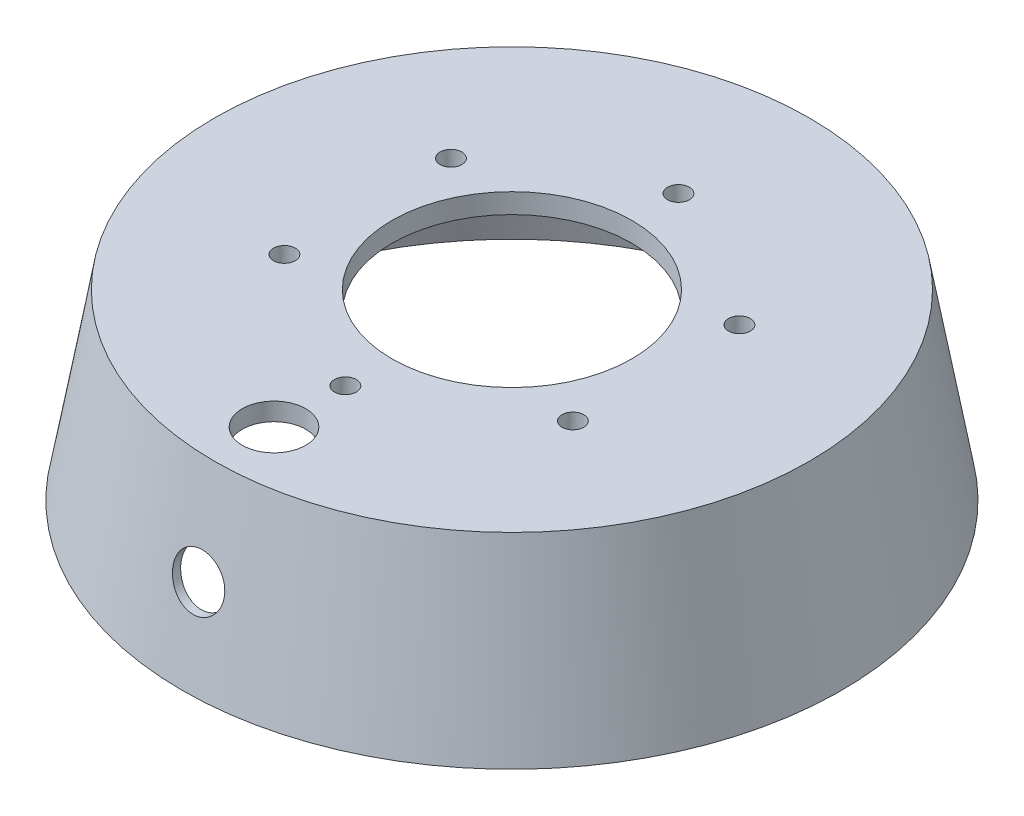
ISO-10303-21;
HEADER;
FILE_DESCRIPTION(('STEP AP214'),'2;1');
FILE_NAME('part.step','',(''),(''),'','','');
FILE_SCHEMA(('AUTOMOTIVE_DESIGN { 1 0 10303 214 1 1 1 1 }'));
ENDSEC;
DATA;
#1=APPLICATION_CONTEXT('core data for automotive mechanical design processes');
#2=APPLICATION_PROTOCOL_DEFINITION('international standard','automotive_design',2000,#1);
#3=PRODUCT_CONTEXT('',#1,'mechanical');
#4=PRODUCT('Part','Part','',(#3));
#5=PRODUCT_RELATED_PRODUCT_CATEGORY('part','',(#4));
#6=PRODUCT_DEFINITION_FORMATION('','',#4);
#7=PRODUCT_DEFINITION_CONTEXT('part definition',#1,'design');
#8=PRODUCT_DEFINITION('design','',#6,#7);
#9=PRODUCT_DEFINITION_SHAPE('','',#8);
#10=(LENGTH_UNIT() NAMED_UNIT(*) SI_UNIT(.MILLI.,.METRE.));
#11=(NAMED_UNIT(*) PLANE_ANGLE_UNIT() SI_UNIT($,.RADIAN.));
#12=(NAMED_UNIT(*) SI_UNIT($,.STERADIAN.) SOLID_ANGLE_UNIT());
#13=UNCERTAINTY_MEASURE_WITH_UNIT(LENGTH_MEASURE(1.E-05),#10,'distance_accuracy_value','');
#14=(GEOMETRIC_REPRESENTATION_CONTEXT(3) GLOBAL_UNCERTAINTY_ASSIGNED_CONTEXT((#13)) GLOBAL_UNIT_ASSIGNED_CONTEXT((#10,
#11,#12)) REPRESENTATION_CONTEXT('',''));
#15=CARTESIAN_POINT('',(0.,0.,0.));
#16=DIRECTION('',(0.,0.,1.));
#17=DIRECTION('',(1.,0.,0.));
#18=AXIS2_PLACEMENT_3D('',#15,#16,#17);
#19=CARTESIAN_POINT('',(0.,56.24908283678,0.));
#20=DIRECTION('',(0.,-1.,0.));
#21=DIRECTION('',(0.,0.,-1.));
#22=AXIS2_PLACEMENT_3D('',#19,#20,#21);
#23=CONICAL_SURFACE('',#22,75.,0.174532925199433);
#24=CARTESIAN_POINT('',(0.,56.24908283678,0.));
#25=DIRECTION('',(0.,1.,0.));
#26=DIRECTION('',(0.,0.,1.));
#27=AXIS2_PLACEMENT_3D('',#24,#25,#26);
#28=CIRCLE('',#27,75.);
#29=CARTESIAN_POINT('',(0.,56.24908283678,75.));
#30=VERTEX_POINT('',#29);
#31=EDGE_CURVE('E11',#30,#30,#28,.T.);
#32=ORIENTED_EDGE('',*,*,#31,.F.);
#33=EDGE_LOOP('',(#32));
#34=FACE_BOUND('',#33,.T.);
#35=CARTESIAN_POINT('',(0.,10.2549872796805,0.));
#36=DIRECTION('',(0.,1.,0.));
#37=DIRECTION('',(0.,0.,1.));
#38=AXIS2_PLACEMENT_3D('',#35,#36,#37);
#39=CIRCLE('',#38,83.11);
#40=CARTESIAN_POINT('',(0.,10.2549872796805,83.11));
#41=VERTEX_POINT('',#40);
#42=EDGE_CURVE('E49',#41,#41,#39,.T.);
#43=ORIENTED_EDGE('',*,*,#42,.T.);
#44=EDGE_LOOP('',(#43));
#45=FACE_BOUND('',#44,.T.);
#46=CARTESIAN_POINT('',(-4.53866936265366,27.3660738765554,79.9641516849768));
#47=CARTESIAN_POINT('',(-4.67174643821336,27.4958797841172,79.933673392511));
#48=CARTESIAN_POINT('',(-4.79912119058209,27.6312719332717,79.9021927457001));
#49=CARTESIAN_POINT('',(-5.04169042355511,27.912282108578,79.837606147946));
#50=CARTESIAN_POINT('',(-5.15688113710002,28.0579032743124,79.8044996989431));
#51=CARTESIAN_POINT('',(-5.37439098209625,28.3584314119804,79.7370355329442));
#52=CARTESIAN_POINT('',(-5.47669605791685,28.5133482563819,79.7026765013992));
#53=CARTESIAN_POINT('',(-5.66765551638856,28.8312811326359,79.6331233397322));
#54=CARTESIAN_POINT('',(-5.75630478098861,28.9943001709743,79.5979289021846));
#55=CARTESIAN_POINT('',(-5.91921323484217,29.3270237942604,79.5271498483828));
#56=CARTESIAN_POINT('',(-5.99349083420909,29.4967194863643,79.4915657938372));
#57=CARTESIAN_POINT('',(-6.12732091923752,29.8418799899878,79.4203202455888));
#58=CARTESIAN_POINT('',(-6.18686798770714,30.0173468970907,79.384658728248));
#59=CARTESIAN_POINT('',(-6.29074875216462,30.3726575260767,79.3136469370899));
#60=CARTESIAN_POINT('',(-6.33509258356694,30.5524982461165,79.2782964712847));
#61=CARTESIAN_POINT('',(-6.40830524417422,30.9154900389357,79.2081978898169));
#62=CARTESIAN_POINT('',(-6.43716837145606,31.098642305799,79.1734500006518));
#63=CARTESIAN_POINT('',(-6.47925005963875,31.4677436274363,79.1047170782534));
#64=CARTESIAN_POINT('',(-6.49239756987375,31.653701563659,79.0707361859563));
#65=CARTESIAN_POINT('',(-6.50266883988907,32.0263453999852,79.0039629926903));
#66=CARTESIAN_POINT('',(-6.49978662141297,32.2130315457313,78.971171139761));
#67=CARTESIAN_POINT('',(-6.47794896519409,32.5856464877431,78.907042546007));
#68=CARTESIAN_POINT('',(-6.45899915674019,32.771575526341,78.8757052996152));
#69=CARTESIAN_POINT('',(-6.40509508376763,33.1414446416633,78.8146681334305));
#70=CARTESIAN_POINT('',(-6.37013498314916,33.325383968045,78.784968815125));
#71=CARTESIAN_POINT('',(-6.28483819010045,33.6879552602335,78.7276844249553));
#72=CARTESIAN_POINT('',(-6.2346632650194,33.8666223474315,78.7000807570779));
#73=CARTESIAN_POINT('',(-6.1191183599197,34.2192685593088,78.646780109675));
#74=CARTESIAN_POINT('',(-6.05374837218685,34.3932476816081,78.6210831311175));
#75=CARTESIAN_POINT('',(-5.90823702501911,34.7351935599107,78.5716875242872));
#76=CARTESIAN_POINT('',(-5.82809685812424,34.903160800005,78.5479887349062));
#77=CARTESIAN_POINT('',(-5.65357656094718,35.231821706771,78.5026410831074));
#78=CARTESIAN_POINT('',(-5.55919624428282,35.3925152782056,78.4809922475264));
#79=CARTESIAN_POINT('',(-5.35837782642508,35.7030284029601,78.4400777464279));
#80=CARTESIAN_POINT('',(-5.25214314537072,35.8529754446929,78.4207810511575));
#81=CARTESIAN_POINT('',(-5.027191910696,36.1435362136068,78.3841840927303));
#82=CARTESIAN_POINT('',(-4.90847107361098,36.2841467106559,78.3668845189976));
#83=CARTESIAN_POINT('',(-4.6594470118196,36.5548679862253,78.334264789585));
#84=CARTESIAN_POINT('',(-4.52914852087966,36.6849830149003,78.3189438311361));
#85=CARTESIAN_POINT('',(-4.25786399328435,36.9338095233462,78.2902219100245));
#86=CARTESIAN_POINT('',(-4.11687404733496,37.0525167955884,78.276821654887));
#87=CARTESIAN_POINT('',(-3.68232273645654,37.3877998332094,78.2396711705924));
#88=CARTESIAN_POINT('',(-3.37441319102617,37.5865362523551,78.2186173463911));
#89=CARTESIAN_POINT('',(-2.72948110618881,37.929541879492,78.1832595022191));
#90=CARTESIAN_POINT('',(-2.39245918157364,38.0738122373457,78.168955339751));
#91=CARTESIAN_POINT('',(-1.70006135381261,38.3033679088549,78.1465847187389));
#92=CARTESIAN_POINT('',(-1.34475930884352,38.388873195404,78.1384949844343));
#93=CARTESIAN_POINT('',(-0.624787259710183,38.4992296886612,78.1281085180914));
#94=CARTESIAN_POINT('',(-0.2601173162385,38.5240812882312,78.1258117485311));
#95=CARTESIAN_POINT('',(0.46793953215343,38.5124231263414,78.126897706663));
#96=CARTESIAN_POINT('',(0.831327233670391,38.4759627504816,78.1302758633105));
#97=CARTESIAN_POINT('',(1.54679508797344,38.3428341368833,78.1428657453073));
#98=CARTESIAN_POINT('',(1.89887528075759,38.2461661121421,78.1520774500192));
#99=CARTESIAN_POINT('',(2.58174046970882,37.9954450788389,78.1767339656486));
#100=CARTESIAN_POINT('',(2.91252544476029,37.841392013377,78.1921787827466));
#101=CARTESIAN_POINT('',(3.54343462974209,37.4804157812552,78.2298453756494));
#102=CARTESIAN_POINT('',(3.84355902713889,37.2734929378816,78.2520671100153));
#103=CARTESIAN_POINT('',(4.40494503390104,36.8126666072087,78.3038609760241));
#104=CARTESIAN_POINT('',(4.66617460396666,36.5587247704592,78.3334391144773));
#105=CARTESIAN_POINT('',(5.14223714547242,36.0114429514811,78.4003385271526));
#106=CARTESIAN_POINT('',(5.35706986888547,35.7181027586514,78.437659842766));
#107=CARTESIAN_POINT('',(5.73528206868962,35.0994235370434,78.520296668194));
#108=CARTESIAN_POINT('',(5.89846348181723,34.7739674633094,78.5656419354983));
#109=CARTESIAN_POINT('',(6.16807612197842,34.1014104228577,78.6638905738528));
#110=CARTESIAN_POINT('',(6.274504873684,33.7543085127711,78.7167942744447));
#111=CARTESIAN_POINT('',(6.42890795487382,33.044892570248,78.8298406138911));
#112=CARTESIAN_POINT('',(6.4763002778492,32.6824629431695,78.8900490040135));
#113=CARTESIAN_POINT('',(6.50985431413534,31.9555267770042,79.015901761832));
#114=CARTESIAN_POINT('',(6.49601067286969,31.5910200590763,79.0815466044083));
#115=CARTESIAN_POINT('',(6.42969573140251,31.0479504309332,79.1830241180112));
#116=CARTESIAN_POINT('',(6.39958453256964,30.8661511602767,79.2176312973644));
#117=CARTESIAN_POINT('',(6.32408427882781,30.5058839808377,79.2874217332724));
#118=CARTESIAN_POINT('',(6.27870057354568,30.3274149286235,79.3226047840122));
#119=CARTESIAN_POINT('',(6.17295760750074,29.9749498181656,79.3932404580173));
#120=CARTESIAN_POINT('',(6.11259176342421,29.800955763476,79.4286931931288));
#121=CARTESIAN_POINT('',(5.97733766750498,29.4587576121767,79.4994952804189));
#122=CARTESIAN_POINT('',(5.90245469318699,29.2905514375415,79.5348446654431));
#123=CARTESIAN_POINT('',(5.7377529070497,28.95921453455,79.6054723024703));
#124=CARTESIAN_POINT('',(5.64777955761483,28.7961595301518,79.6407455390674));
#125=CARTESIAN_POINT('',(5.45412161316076,28.4782948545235,79.7104214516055));
#126=CARTESIAN_POINT('',(5.35044212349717,28.3234821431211,79.7448244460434));
#127=CARTESIAN_POINT('',(5.12998691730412,28.0230902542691,79.8123862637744));
#128=CARTESIAN_POINT('',(5.01320599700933,27.877514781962,79.8455445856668));
#129=CARTESIAN_POINT('',(4.76740382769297,27.5967924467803,79.9101846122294));
#130=CARTESIAN_POINT('',(4.63838742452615,27.46164149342,79.9416669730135));
#131=CARTESIAN_POINT('',(4.36971156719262,27.2034695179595,80.0023923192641));
#132=CARTESIAN_POINT('',(4.23011721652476,27.0803835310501,80.031647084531));
#133=CARTESIAN_POINT('',(3.94064460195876,26.8464691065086,80.0877175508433));
#134=CARTESIAN_POINT('',(3.79077049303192,26.7356357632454,80.114534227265));
#135=CARTESIAN_POINT('',(3.48167988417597,26.5270268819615,80.1653799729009));
#136=CARTESIAN_POINT('',(3.32246066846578,26.4292551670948,80.189408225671));
#137=CARTESIAN_POINT('',(2.99591853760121,26.2476568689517,80.234314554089));
#138=CARTESIAN_POINT('',(2.82859903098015,26.1638244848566,80.255193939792));
#139=CARTESIAN_POINT('',(2.49115473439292,26.0126279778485,80.2930410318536));
#140=CARTESIAN_POINT('',(2.32119559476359,25.9449146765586,80.3100911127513));
#141=CARTESIAN_POINT('',(1.97595426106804,25.8240006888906,80.3406535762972));
#142=CARTESIAN_POINT('',(1.80067420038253,25.7707942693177,80.3541673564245));
#143=CARTESIAN_POINT('',(1.44601340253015,25.6793207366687,80.3774638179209));
#144=CARTESIAN_POINT('',(1.26663264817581,25.641053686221,80.3872464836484));
#145=CARTESIAN_POINT('',(0.905114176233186,25.5797988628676,80.4029312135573));
#146=CARTESIAN_POINT('',(0.722976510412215,25.556810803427,80.4088333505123));
#147=CARTESIAN_POINT('',(0.362258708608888,25.5267306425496,80.4165604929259));
#148=CARTESIAN_POINT('',(0.183715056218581,25.5192266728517,80.4184911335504));
#149=CARTESIAN_POINT('',(-0.173444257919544,25.5189430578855,80.4185640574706));
#150=CARTESIAN_POINT('',(-0.352059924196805,25.5261682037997,80.4167051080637));
#151=CARTESIAN_POINT('',(-0.708011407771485,25.5552907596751,80.4092237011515));
#152=CARTESIAN_POINT('',(-0.88534721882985,25.5771882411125,80.4036012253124));
#153=CARTESIAN_POINT('',(-1.23746538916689,25.6354689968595,80.3886751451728));
#154=CARTESIAN_POINT('',(-1.41224773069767,25.6718523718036,80.3793715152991));
#155=CARTESIAN_POINT('',(-1.75679894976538,25.7584925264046,80.357295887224));
#156=CARTESIAN_POINT('',(-1.92659446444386,25.8086498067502,80.3445487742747));
#157=CARTESIAN_POINT('',(-2.26122282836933,25.9225184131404,80.315741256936));
#158=CARTESIAN_POINT('',(-2.42605730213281,25.9862252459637,80.2996819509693));
#159=CARTESIAN_POINT('',(-2.74958871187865,26.1266442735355,80.2644804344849));
#160=CARTESIAN_POINT('',(-2.90829050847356,26.2033458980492,80.2453407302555));
#161=CARTESIAN_POINT('',(-3.21861586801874,26.3691746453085,80.204229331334));
#162=CARTESIAN_POINT('',(-3.37024111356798,26.4582987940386,80.1822583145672));
#163=CARTESIAN_POINT('',(-3.70147487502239,26.6714915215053,80.1300937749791));
#164=CARTESIAN_POINT('',(-3.87890915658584,26.7987850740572,80.099200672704));
#165=CARTESIAN_POINT('',(-4.21971663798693,27.0701987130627,80.0340455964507));
#166=CARTESIAN_POINT('',(-4.38308990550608,27.2143187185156,79.9997836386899));
#167=CARTESIAN_POINT('',(-4.53866936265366,27.3660738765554,79.9641516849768));
#168=B_SPLINE_CURVE_WITH_KNOTS('',3,(#46,#47,#48,#49,#50,#51,#52,#53,#54,#55,#56,#57,#58,#59,
#60,#61,#62,#63,#64,#65,#66,#67,#68,#69,#70,#71,#72,#73,#74,#75,#76,#77,#78,#79,#80,#81,#82,#83,
#84,#85,#86,#87,#88,#89,#90,#91,#92,#93,#94,#95,#96,#97,#98,#99,#100,#101,#102,#103,#104,#105,
#106,#107,#108,#109,#110,#111,#112,#113,#114,#115,#116,#117,#118,#119,#120,#121,#122,#123,#124,
#125,#126,#127,#128,#129,#130,#131,#132,#133,#134,#135,#136,#137,#138,#139,#140,#141,#142,#143,
#144,#145,#146,#147,#148,#149,#150,#151,#152,#153,#154,#155,#156,#157,#158,#159,#160,#161,#162,
#163,#164,#165,#166,#167),.UNSPECIFIED.,.T.,.F.,(4,2,2,2,2,2,2,2,2,2,2,2,2,2,2,2,2,2,2,2,2,2,2,
2,2,2,2,2,2,2,2,2,2,2,2,2,2,2,2,2,2,2,2,2,2,2,2,2,2,2,2,2,2,2,2,2,2,2,2,2,4),(0.,
0.564949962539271,1.13007408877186,1.69580940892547,2.26175624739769,2.82697323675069,
3.39239777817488,3.95744463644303,4.52269947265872,5.09050028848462,5.65851287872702,
6.22632654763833,6.79434736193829,7.35652887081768,7.91871066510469,8.48084708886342,
9.04299087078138,9.59665277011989,10.1505052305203,10.7041322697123,11.2579627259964,
12.3534934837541,13.4490011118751,14.5403853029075,15.6317624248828,16.7222608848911,
17.8127554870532,18.9032511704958,19.9937401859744,21.085122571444,22.1765107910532,
23.2720347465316,24.367606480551,25.4738954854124,26.5802812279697,27.1422352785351,
27.7039926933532,28.2659973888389,28.8277981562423,29.3957493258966,29.9634895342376,
30.5314560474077,31.0991985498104,31.6636933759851,32.2279613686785,32.7923941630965,
33.3565914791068,33.9071469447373,34.4574845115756,35.0078243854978,35.5581539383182,
36.0936457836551,36.6293118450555,37.1649805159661,37.7006529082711,38.2325531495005,
38.7642772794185,39.2955709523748,39.8267376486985,40.4872197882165,41.1476987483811),.UNSPECIFIED.);
#169=CARTESIAN_POINT('',(-4.53866936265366,27.3660738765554,79.9641516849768));
#170=VERTEX_POINT('',#169);
#171=EDGE_CURVE('E110',#170,#170,#168,.T.);
#172=ORIENTED_EDGE('',*,*,#171,.T.);
#173=EDGE_LOOP('',(#172));
#174=FACE_BOUND('',#173,.T.);
#175=ADVANCED_FACE('F36',(#34,#45,#174),#23,.T.);
#176=CARTESIAN_POINT('',(0.,9.90233331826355,0.));
#177=DIRECTION('',(0.,-1.,0.));
#178=DIRECTION('',(0.,0.,-1.));
#179=AXIS2_PLACEMENT_3D('',#176,#177,#178);
#180=CONICAL_SURFACE('',#179,81.11,0.174532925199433);
#181=CARTESIAN_POINT('',(0.,9.90233331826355,0.));
#182=DIRECTION('',(0.,1.,0.));
#183=DIRECTION('',(0.,0.,1.));
#184=AXIS2_PLACEMENT_3D('',#181,#182,#183);
#185=CIRCLE('',#184,81.11);
#186=CARTESIAN_POINT('',(0.,9.90233331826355,81.11));
#187=VERTEX_POINT('',#186);
#188=EDGE_CURVE('E82',#187,#187,#185,.T.);
#189=ORIENTED_EDGE('',*,*,#188,.F.);
#190=EDGE_LOOP('',(#189));
#191=FACE_BOUND('',#190,.T.);
#192=CARTESIAN_POINT('',(0.,47.7700273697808,0.));
#193=DIRECTION('',(0.,1.,0.));
#194=DIRECTION('',(0.,0.,1.));
#195=AXIS2_PLACEMENT_3D('',#192,#193,#194);
#196=CIRCLE('',#195,74.4329038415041);
#197=CARTESIAN_POINT('',(0.,47.7700273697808,74.4329038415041));
#198=VERTEX_POINT('',#197);
#199=EDGE_CURVE('E78',#198,#198,#196,.T.);
#200=ORIENTED_EDGE('',*,*,#199,.T.);
#201=EDGE_LOOP('',(#200));
#202=FACE_BOUND('',#201,.T.);
#203=CARTESIAN_POINT('',(-4.52533748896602,27.3531066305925,77.901628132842));
#204=CARTESIAN_POINT('',(-4.39644316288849,27.2280944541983,77.9311960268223));
#205=CARTESIAN_POINT('',(-4.26227641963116,27.1083427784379,77.9598139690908));
#206=CARTESIAN_POINT('',(-3.98416149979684,26.8801332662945,78.0148141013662));
#207=CARTESIAN_POINT('',(-3.84021152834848,26.7716775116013,78.0411958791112));
#208=CARTESIAN_POINT('',(-3.54340565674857,26.5668527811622,78.0913885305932));
#209=CARTESIAN_POINT('',(-3.39054454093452,26.4704909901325,78.1151978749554));
#210=CARTESIAN_POINT('',(-3.07694769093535,26.2906385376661,78.159916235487));
#211=CARTESIAN_POINT('',(-2.91620922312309,26.2071523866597,78.1808242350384));
#212=CARTESIAN_POINT('',(-2.58790012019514,26.0537139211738,78.2194504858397));
#213=CARTESIAN_POINT('',(-2.42032521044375,25.9837702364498,78.2371667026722));
#214=CARTESIAN_POINT('',(-2.07961629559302,25.8580629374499,78.2691376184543));
#215=CARTESIAN_POINT('',(-1.90648231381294,25.8022992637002,78.2833923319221));
#216=CARTESIAN_POINT('',(-1.55594817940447,25.705440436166,78.3082259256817));
#217=CARTESIAN_POINT('',(-1.3785491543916,25.664341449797,78.3188057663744));
#218=CARTESIAN_POINT('',(-1.02074358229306,25.5971503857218,78.3361347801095));
#219=CARTESIAN_POINT('',(-0.840337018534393,25.5710583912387,78.3428839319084));
#220=CARTESIAN_POINT('',(-0.481388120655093,25.5344720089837,78.3523550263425));
#221=CARTESIAN_POINT('',(-0.302877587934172,25.523684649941,78.3551526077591));
#222=CARTESIAN_POINT('',(0.0545067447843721,25.5168538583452,78.3569235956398));
#223=CARTESIAN_POINT('',(0.233380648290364,25.5208154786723,78.3558956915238));
#224=CARTESIAN_POINT('',(0.590059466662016,25.5434553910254,78.3500292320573));
#225=CARTESIAN_POINT('',(0.76786477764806,25.5621278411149,78.3451921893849));
#226=CARTESIAN_POINT('',(1.12126136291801,25.614031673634,78.3317785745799));
#227=CARTESIAN_POINT('',(1.29685179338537,25.6472684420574,78.3232006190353));
#228=CARTESIAN_POINT('',(1.64284586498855,25.7276361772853,78.3025295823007));
#229=CARTESIAN_POINT('',(1.81328292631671,25.7746322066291,78.290470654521));
#230=CARTESIAN_POINT('',(2.1495793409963,25.8822684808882,78.262972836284));
#231=CARTESIAN_POINT('',(2.31543701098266,25.9429136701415,78.2475327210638));
#232=CARTESIAN_POINT('',(2.64134112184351,26.077334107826,78.2134939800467));
#233=CARTESIAN_POINT('',(2.80138944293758,26.1511050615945,78.1948963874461));
#234=CARTESIAN_POINT('',(3.11474206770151,26.3112501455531,78.1547814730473));
#235=CARTESIAN_POINT('',(3.26804381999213,26.3976289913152,78.1332630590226));
#236=CARTESIAN_POINT('',(3.56923468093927,26.583790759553,78.0872287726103));
#237=CARTESIAN_POINT('',(3.71699940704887,26.6837645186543,78.0626707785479));
#238=CARTESIAN_POINT('',(4.0036001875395,26.8953217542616,78.0111446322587));
#239=CARTESIAN_POINT('',(4.14243293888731,27.0069094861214,77.9841755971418));
#240=CARTESIAN_POINT('',(4.41021937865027,27.240845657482,77.9281747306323));
#241=CARTESIAN_POINT('',(4.53917550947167,27.3631914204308,77.8991434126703));
#242=CARTESIAN_POINT('',(4.78647675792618,27.6178107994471,77.8393584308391));
#243=CARTESIAN_POINT('',(4.90481787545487,27.7500881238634,77.8086041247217));
#244=CARTESIAN_POINT('',(5.24913916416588,28.1682315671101,77.7125084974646));
#245=CARTESIAN_POINT('',(5.45695899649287,28.4689033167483,77.6449088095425));
#246=CARTESIAN_POINT('',(5.81913045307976,29.1001196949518,77.5069955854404));
#247=CARTESIAN_POINT('',(5.9734753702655,29.4306680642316,77.4366817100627));
#248=CARTESIAN_POINT('',(6.22740981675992,30.1199091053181,77.2947551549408));
#249=CARTESIAN_POINT('',(6.32582568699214,30.4790365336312,77.2231450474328));
#250=CARTESIAN_POINT('',(6.46004792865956,31.2093555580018,77.0828080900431));
#251=CARTESIAN_POINT('',(6.49585317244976,31.5805473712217,77.0140812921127));
#252=CARTESIAN_POINT('',(6.5034683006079,32.3247978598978,76.8817395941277));
#253=CARTESIAN_POINT('',(6.47523313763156,32.6978576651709,76.8181283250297));
#254=CARTESIAN_POINT('',(6.35494782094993,33.4346949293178,76.6978035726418));
#255=CARTESIAN_POINT('',(6.26290221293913,33.7984730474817,76.6410895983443));
#256=CARTESIAN_POINT('',(6.01880995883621,34.5010974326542,76.5363676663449));
#257=CARTESIAN_POINT('',(5.86757982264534,34.8402114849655,76.4882536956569));
#258=CARTESIAN_POINT('',(5.50906920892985,35.4885707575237,76.4002897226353));
#259=CARTESIAN_POINT('',(5.30179310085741,35.7978183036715,76.3604390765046));
#260=CARTESIAN_POINT('',(4.8402691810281,36.3729115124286,76.2894627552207));
#261=CARTESIAN_POINT('',(4.58672414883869,36.6393071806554,76.258222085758));
#262=CARTESIAN_POINT('',(4.03792039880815,37.1259087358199,76.2033269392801));
#263=CARTESIAN_POINT('',(3.74266346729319,37.3461165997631,76.1796721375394));
#264=CARTESIAN_POINT('',(3.12127187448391,37.7322664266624,76.1395045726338));
#265=CARTESIAN_POINT('',(2.79538883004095,37.8986079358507,76.1229389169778));
#266=CARTESIAN_POINT('',(2.12013913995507,38.1744065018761,76.0960866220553));
#267=CARTESIAN_POINT('',(1.77077283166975,38.2838643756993,76.0857998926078));
#268=CARTESIAN_POINT('',(1.05933973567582,38.4425030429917,76.071050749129));
#269=CARTESIAN_POINT('',(0.697303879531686,38.4918213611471,76.066575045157));
#270=CARTESIAN_POINT('',(-0.0299431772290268,38.5292033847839,76.0631735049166));
#271=CARTESIAN_POINT('',(-0.395154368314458,38.5172672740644,76.0642476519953));
#272=CARTESIAN_POINT('',(-1.1182531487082,38.432505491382,76.0720010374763));
#273=CARTESIAN_POINT('',(-1.47614314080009,38.3597001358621,76.0786784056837));
#274=CARTESIAN_POINT('',(-2.17457710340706,38.1553338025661,76.0979696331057));
#275=CARTESIAN_POINT('',(-2.51512116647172,38.0237731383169,76.1105834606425));
#276=CARTESIAN_POINT('',(-3.16920242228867,37.7057767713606,76.1422762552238));
#277=CARTESIAN_POINT('',(-3.48273684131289,37.5193354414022,76.161355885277));
#278=CARTESIAN_POINT('',(-4.07406337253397,37.0968626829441,76.2066148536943));
#279=CARTESIAN_POINT('',(-4.35185565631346,36.8608314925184,76.2327941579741));
#280=CARTESIAN_POINT('',(-4.73577272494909,36.475046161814,76.2777489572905));
#281=CARTESIAN_POINT('',(-4.858402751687,36.3409923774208,76.2937027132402));
#282=CARTESIAN_POINT('',(-5.09190427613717,36.063259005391,76.3275547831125));
#283=CARTESIAN_POINT('',(-5.20278001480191,35.9195829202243,76.3454523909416));
#284=CARTESIAN_POINT('',(-5.41205675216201,35.6235971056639,76.3832238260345));
#285=CARTESIAN_POINT('',(-5.51045316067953,35.4712842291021,76.4030983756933));
#286=CARTESIAN_POINT('',(-5.69405133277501,35.159231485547,76.4448106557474));
#287=CARTESIAN_POINT('',(-5.77925779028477,34.9994942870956,76.4666476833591));
#288=CARTESIAN_POINT('',(-5.93639161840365,34.6728137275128,76.5123855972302));
#289=CARTESIAN_POINT('',(-6.00824419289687,34.5058358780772,76.5362970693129));
#290=CARTESIAN_POINT('',(-6.1376209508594,34.1667617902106,76.5860104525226));
#291=CARTESIAN_POINT('',(-6.19515017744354,33.9946673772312,76.6118116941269));
#292=CARTESIAN_POINT('',(-6.29558966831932,33.6464718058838,76.6652265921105));
#293=CARTESIAN_POINT('',(-6.33849467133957,33.4703692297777,76.6928408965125));
#294=CARTESIAN_POINT('',(-6.40941071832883,33.1155225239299,76.7497338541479));
#295=CARTESIAN_POINT('',(-6.4374269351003,32.9367793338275,76.7790119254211));
#296=CARTESIAN_POINT('',(-6.47870365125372,32.5756913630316,76.8394356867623));
#297=CARTESIAN_POINT('',(-6.49178431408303,32.3933290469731,76.8705994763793));
#298=CARTESIAN_POINT('',(-6.50255449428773,32.02844963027,76.934256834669));
#299=CARTESIAN_POINT('',(-6.50024933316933,31.8459326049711,76.9667499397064));
#300=CARTESIAN_POINT('',(-6.48032506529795,31.4818188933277,77.0328600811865));
#301=CARTESIAN_POINT('',(-6.46269599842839,31.3002228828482,77.0664778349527));
#302=CARTESIAN_POINT('',(-6.41228521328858,30.939371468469,77.1345360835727));
#303=CARTESIAN_POINT('',(-6.3795087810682,30.7601152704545,77.1689762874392));
#304=CARTESIAN_POINT('',(-6.29841837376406,30.4022598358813,77.2389466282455));
#305=CARTESIAN_POINT('',(-6.24986570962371,30.2237163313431,77.2744853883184));
#306=CARTESIAN_POINT('',(-6.13776082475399,29.8715178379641,77.3457678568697));
#307=CARTESIAN_POINT('',(-6.07421383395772,29.6978611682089,77.3815114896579));
#308=CARTESIAN_POINT('',(-5.93259633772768,29.3566803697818,77.4528332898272));
#309=CARTESIAN_POINT('',(-5.85453596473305,29.1891520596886,77.4884115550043));
#310=CARTESIAN_POINT('',(-5.68441699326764,28.8613124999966,77.5590388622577));
#311=CARTESIAN_POINT('',(-5.59236147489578,28.7009996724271,77.5940880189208));
#312=CARTESIAN_POINT('',(-5.35672796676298,28.3284221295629,77.6766232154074));
#313=CARTESIAN_POINT('',(-5.20696454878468,28.1199396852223,77.7236979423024));
#314=CARTESIAN_POINT('',(-4.88351364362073,27.7217480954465,77.8150398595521));
#315=CARTESIAN_POINT('',(-4.70982629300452,27.5320388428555,77.8593070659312));
#316=CARTESIAN_POINT('',(-4.52533748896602,27.3531066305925,77.901628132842));
#317=B_SPLINE_CURVE_WITH_KNOTS('',3,(#203,#204,#205,#206,#207,#208,#209,#210,#211,#212,#213,
#214,#215,#216,#217,#218,#219,#220,#221,#222,#223,#224,#225,#226,#227,#228,#229,#230,#231,#232,
#233,#234,#235,#236,#237,#238,#239,#240,#241,#242,#243,#244,#245,#246,#247,#248,#249,#250,#251,
#252,#253,#254,#255,#256,#257,#258,#259,#260,#261,#262,#263,#264,#265,#266,#267,#268,#269,#270,
#271,#272,#273,#274,#275,#276,#277,#278,#279,#280,#281,#282,#283,#284,#285,#286,#287,#288,#289,
#290,#291,#292,#293,#294,#295,#296,#297,#298,#299,#300,#301,#302,#303,#304,#305,#306,#307,#308,
#309,#310,#311,#312,#313,#314,#315,#316),.UNSPECIFIED.,.T.,.F.,(4,2,2,2,2,2,2,2,2,2,2,2,2,2,2,2,
2,2,2,2,2,2,2,2,2,2,2,2,2,2,2,2,2,2,2,2,2,2,2,2,2,2,2,2,2,2,2,2,2,2,2,2,2,2,2,2,4),(0.,
0.545719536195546,1.09153946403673,1.63768213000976,2.18401568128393,2.7306962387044,
3.27737450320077,3.82390978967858,4.37044810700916,4.90637617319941,5.44248786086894,
5.97838675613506,6.51448399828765,7.04549042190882,7.57668951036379,8.1077151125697,
8.63893983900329,9.17858857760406,9.71843574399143,10.2581489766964,10.7980647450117,
11.9076027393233,13.0172798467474,14.1494564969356,15.2816535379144,16.4146472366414,
17.5475602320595,18.6653653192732,19.7830832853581,20.885056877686,21.9869832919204,
23.0805384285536,24.174077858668,25.2651119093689,26.3561426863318,27.4468094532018,
28.5374704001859,29.628243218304,30.719010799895,31.2656271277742,31.812045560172,
32.3586643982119,32.9050882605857,33.4544860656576,34.0036901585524,34.5530916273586,
35.1023020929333,35.6580579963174,36.2136216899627,36.769546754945,37.3252779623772,
37.8898425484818,38.454210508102,39.018185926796,39.5820374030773,40.3631402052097,
41.1442385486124),.UNSPECIFIED.);
#318=CARTESIAN_POINT('',(-4.52533748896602,27.3531066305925,77.901628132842));
#319=VERTEX_POINT('',#318);
#320=EDGE_CURVE('E40',#319,#319,#317,.T.);
#321=ORIENTED_EDGE('',*,*,#320,.T.);
#322=EDGE_LOOP('',(#321));
#323=FACE_BOUND('',#322,.T.);
#324=ADVANCED_FACE('F164',(#191,#202,#323),#180,.F.);
#325=CARTESIAN_POINT('',(0.,9.90233331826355,0.));
#326=DIRECTION('',(0.,1.,0.));
#327=DIRECTION('',(0.,0.,1.));
#328=AXIS2_PLACEMENT_3D('',#325,#326,#327);
#329=CYLINDRICAL_SURFACE('',#328,30.25);
#330=CARTESIAN_POINT('',(0.,56.24908283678,0.));
#331=DIRECTION('',(0.,1.,0.));
#332=DIRECTION('',(0.,0.,1.));
#333=AXIS2_PLACEMENT_3D('',#330,#331,#332);
#334=CIRCLE('',#333,30.25);
#335=CARTESIAN_POINT('',(0.,56.24908283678,30.25));
#336=VERTEX_POINT('',#335);
#337=EDGE_CURVE('E79',#336,#336,#334,.T.);
#338=CARTESIAN_POINT('',(0.,51.24908283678,0.));
#339=DIRECTION('',(0.,-1.,0.));
#340=DIRECTION('',(0.,0.,-1.));
#341=AXIS2_PLACEMENT_3D('',#338,#339,#340);
#342=CIRCLE('',#341,30.25);
#343=CARTESIAN_POINT('',(0.,51.24908283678,30.25));
#344=VERTEX_POINT('',#343);
#345=EDGE_CURVE('E64',#344,#344,#342,.F.);
#346=CARTESIAN_POINT('',(0.,56.24908283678,30.25));
#347=CARTESIAN_POINT('',(0.,56.1969995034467,30.25));
#348=CARTESIAN_POINT('',(0.,56.1449161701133,30.25));
#349=CARTESIAN_POINT('',(0.,56.0407495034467,30.25));
#350=CARTESIAN_POINT('',(0.,55.9886661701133,30.25));
#351=CARTESIAN_POINT('',(0.,55.8844995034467,30.25));
#352=CARTESIAN_POINT('',(0.,55.8324161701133,30.25));
#353=CARTESIAN_POINT('',(0.,55.7282495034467,30.25));
#354=CARTESIAN_POINT('',(0.,55.6761661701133,30.25));
#355=CARTESIAN_POINT('',(0.,55.5719995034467,30.25));
#356=CARTESIAN_POINT('',(0.,55.5199161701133,30.25));
#357=CARTESIAN_POINT('',(0.,55.4157495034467,30.25));
#358=CARTESIAN_POINT('',(0.,55.3636661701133,30.25));
#359=CARTESIAN_POINT('',(0.,55.2594995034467,30.25));
#360=CARTESIAN_POINT('',(0.,55.2074161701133,30.25));
#361=CARTESIAN_POINT('',(0.,55.1032495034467,30.25));
#362=CARTESIAN_POINT('',(0.,55.0511661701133,30.25));
#363=CARTESIAN_POINT('',(0.,54.9469995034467,30.25));
#364=CARTESIAN_POINT('',(0.,54.8949161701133,30.25));
#365=CARTESIAN_POINT('',(0.,54.7907495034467,30.25));
#366=CARTESIAN_POINT('',(0.,54.7386661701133,30.25));
#367=CARTESIAN_POINT('',(0.,54.6344995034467,30.25));
#368=CARTESIAN_POINT('',(0.,54.5824161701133,30.25));
#369=CARTESIAN_POINT('',(0.,54.4782495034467,30.25));
#370=CARTESIAN_POINT('',(0.,54.4261661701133,30.25));
#371=CARTESIAN_POINT('',(0.,54.3219995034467,30.25));
#372=CARTESIAN_POINT('',(0.,54.2699161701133,30.25));
#373=CARTESIAN_POINT('',(0.,54.1657495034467,30.25));
#374=CARTESIAN_POINT('',(0.,54.1136661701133,30.25));
#375=CARTESIAN_POINT('',(0.,54.0094995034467,30.25));
#376=CARTESIAN_POINT('',(0.,53.9574161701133,30.25));
#377=CARTESIAN_POINT('',(0.,53.8532495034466,30.25));
#378=CARTESIAN_POINT('',(0.,53.8011661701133,30.25));
#379=CARTESIAN_POINT('',(0.,53.6969995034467,30.25));
#380=CARTESIAN_POINT('',(0.,53.6449161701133,30.25));
#381=CARTESIAN_POINT('',(0.,53.5407495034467,30.25));
#382=CARTESIAN_POINT('',(0.,53.4886661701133,30.25));
#383=CARTESIAN_POINT('',(0.,53.3844995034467,30.25));
#384=CARTESIAN_POINT('',(0.,53.3324161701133,30.25));
#385=CARTESIAN_POINT('',(0.,53.2282495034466,30.25));
#386=CARTESIAN_POINT('',(0.,53.1761661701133,30.25));
#387=CARTESIAN_POINT('',(0.,53.0719995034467,30.25));
#388=CARTESIAN_POINT('',(0.,53.0199161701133,30.25));
#389=CARTESIAN_POINT('',(0.,52.9157495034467,30.25));
#390=CARTESIAN_POINT('',(0.,52.8636661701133,30.25));
#391=CARTESIAN_POINT('',(0.,52.7594995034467,30.25));
#392=CARTESIAN_POINT('',(0.,52.7074161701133,30.25));
#393=CARTESIAN_POINT('',(0.,52.6032495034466,30.25));
#394=CARTESIAN_POINT('',(0.,52.5511661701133,30.25));
#395=CARTESIAN_POINT('',(0.,52.4469995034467,30.25));
#396=CARTESIAN_POINT('',(0.,52.3949161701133,30.25));
#397=CARTESIAN_POINT('',(0.,52.2907495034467,30.25));
#398=CARTESIAN_POINT('',(0.,52.2386661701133,30.25));
#399=CARTESIAN_POINT('',(0.,52.1344995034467,30.25));
#400=CARTESIAN_POINT('',(0.,52.0824161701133,30.25));
#401=CARTESIAN_POINT('',(0.,51.9782495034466,30.25));
#402=CARTESIAN_POINT('',(0.,51.9261661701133,30.25));
#403=CARTESIAN_POINT('',(0.,51.8219995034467,30.25));
#404=CARTESIAN_POINT('',(0.,51.7699161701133,30.25));
#405=CARTESIAN_POINT('',(0.,51.6657495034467,30.25));
#406=CARTESIAN_POINT('',(0.,51.6136661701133,30.25));
#407=CARTESIAN_POINT('',(0.,51.5094995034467,30.25));
#408=CARTESIAN_POINT('',(0.,51.4574161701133,30.25));
#409=CARTESIAN_POINT('',(0.,51.3532495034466,30.25));
#410=CARTESIAN_POINT('',(0.,51.3011661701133,30.25));
#411=CARTESIAN_POINT('',(0.,51.24908283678,30.25));
#412=B_SPLINE_CURVE_WITH_KNOTS('',3,(#346,#347,#348,#349,#350,#351,#352,#353,#354,#355,#356,
#357,#358,#359,#360,#361,#362,#363,#364,#365,#366,#367,#368,#369,#370,#371,#372,#373,#374,#375,
#376,#377,#378,#379,#380,#381,#382,#383,#384,#385,#386,#387,#388,#389,#390,#391,#392,#393,#394,
#395,#396,#397,#398,#399,#400,#401,#402,#403,#404,#405,#406,#407,#408,#409,#410,#411),
.UNSPECIFIED.,.F.,.F.,(4,2,2,2,2,2,2,2,2,2,2,2,2,2,2,2,2,2,2,2,2,2,2,2,2,2,2,2,2,2,2,2,4),(0.,
0.156249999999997,0.3125,0.468750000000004,0.625000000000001,0.781249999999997,
0.937500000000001,1.09375,1.25,1.40625,1.5625,1.71875,1.875,2.03125,2.1875,2.34375000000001,2.5,
2.65625,2.8125,2.96875000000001,3.125,3.28125,3.4375,3.59375000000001,3.75,3.90625,4.0625,
4.21875000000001,4.375,4.53125,4.6875,4.84375000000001,5.),.UNSPECIFIED.);
#413=EDGE_CURVE('BSEAM223',#336,#344,#412,.T.);
#414=ORIENTED_EDGE('',*,*,#337,.T.);
#415=ORIENTED_EDGE('',*,*,#345,.F.);
#416=ORIENTED_EDGE('',*,*,#413,.T.);
#417=ORIENTED_EDGE('',*,*,#413,.F.);
#418=EDGE_LOOP('',(#414,#416,#415,#417));
#419=FACE_BOUND('',#418,.T.);
#420=ADVANCED_FACE('F223',(#419),#329,.F.);
#421=CARTESIAN_POINT('',(0.,-33.75091716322,-42.));
#422=DIRECTION('',(0.,1.,0.));
#423=DIRECTION('',(0.,0.,1.));
#424=AXIS2_PLACEMENT_3D('',#421,#422,#423);
#425=CYLINDRICAL_SURFACE('',#424,2.75);
#426=CARTESIAN_POINT('',(0.,56.24908283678,-42.));
#427=DIRECTION('',(0.,1.,0.));
#428=DIRECTION('',(0.,0.,1.));
#429=AXIS2_PLACEMENT_3D('',#426,#427,#428);
#430=CIRCLE('',#429,2.75);
#431=CARTESIAN_POINT('',(0.,56.24908283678,-39.25));
#432=VERTEX_POINT('',#431);
#433=EDGE_CURVE('E85',#432,#432,#430,.T.);
#434=CARTESIAN_POINT('',(0.,51.24908283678,-42.));
#435=DIRECTION('',(0.,-1.,0.));
#436=DIRECTION('',(0.,0.,-1.));
#437=AXIS2_PLACEMENT_3D('',#434,#435,#436);
#438=CIRCLE('',#437,2.75);
#439=CARTESIAN_POINT('',(0.,51.24908283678,-39.25));
#440=VERTEX_POINT('',#439);
#441=EDGE_CURVE('E124',#440,#440,#438,.F.);
#442=CARTESIAN_POINT('',(0.,56.24908283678,-39.25));
#443=CARTESIAN_POINT('',(0.,56.1969995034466,-39.25));
#444=CARTESIAN_POINT('',(0.,56.1449161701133,-39.25));
#445=CARTESIAN_POINT('',(0.,56.0407495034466,-39.25));
#446=CARTESIAN_POINT('',(0.,55.9886661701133,-39.25));
#447=CARTESIAN_POINT('',(0.,55.8844995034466,-39.25));
#448=CARTESIAN_POINT('',(0.,55.8324161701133,-39.25));
#449=CARTESIAN_POINT('',(0.,55.7282495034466,-39.25));
#450=CARTESIAN_POINT('',(0.,55.6761661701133,-39.25));
#451=CARTESIAN_POINT('',(0.,55.5719995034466,-39.25));
#452=CARTESIAN_POINT('',(0.,55.5199161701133,-39.25));
#453=CARTESIAN_POINT('',(0.,55.4157495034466,-39.25));
#454=CARTESIAN_POINT('',(0.,55.3636661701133,-39.25));
#455=CARTESIAN_POINT('',(0.,55.2594995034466,-39.25));
#456=CARTESIAN_POINT('',(0.,55.2074161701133,-39.25));
#457=CARTESIAN_POINT('',(0.,55.1032495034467,-39.25));
#458=CARTESIAN_POINT('',(0.,55.0511661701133,-39.25));
#459=CARTESIAN_POINT('',(0.,54.9469995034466,-39.25));
#460=CARTESIAN_POINT('',(0.,54.8949161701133,-39.25));
#461=CARTESIAN_POINT('',(0.,54.7907495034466,-39.25));
#462=CARTESIAN_POINT('',(0.,54.7386661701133,-39.25));
#463=CARTESIAN_POINT('',(0.,54.6344995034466,-39.25));
#464=CARTESIAN_POINT('',(0.,54.5824161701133,-39.25));
#465=CARTESIAN_POINT('',(0.,54.4782495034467,-39.25));
#466=CARTESIAN_POINT('',(0.,54.4261661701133,-39.25));
#467=CARTESIAN_POINT('',(0.,54.3219995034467,-39.25));
#468=CARTESIAN_POINT('',(0.,54.2699161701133,-39.25));
#469=CARTESIAN_POINT('',(0.,54.1657495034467,-39.25));
#470=CARTESIAN_POINT('',(0.,54.1136661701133,-39.25));
#471=CARTESIAN_POINT('',(0.,54.0094995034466,-39.25));
#472=CARTESIAN_POINT('',(0.,53.9574161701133,-39.25));
#473=CARTESIAN_POINT('',(0.,53.8532495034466,-39.25));
#474=CARTESIAN_POINT('',(0.,53.8011661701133,-39.25));
#475=CARTESIAN_POINT('',(0.,53.6969995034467,-39.25));
#476=CARTESIAN_POINT('',(0.,53.6449161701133,-39.25));
#477=CARTESIAN_POINT('',(0.,53.5407495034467,-39.25));
#478=CARTESIAN_POINT('',(0.,53.4886661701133,-39.25));
#479=CARTESIAN_POINT('',(0.,53.3844995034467,-39.25));
#480=CARTESIAN_POINT('',(0.,53.3324161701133,-39.25));
#481=CARTESIAN_POINT('',(0.,53.2282495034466,-39.25));
#482=CARTESIAN_POINT('',(0.,53.1761661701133,-39.25));
#483=CARTESIAN_POINT('',(0.,53.0719995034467,-39.25));
#484=CARTESIAN_POINT('',(0.,53.0199161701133,-39.25));
#485=CARTESIAN_POINT('',(0.,52.9157495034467,-39.25));
#486=CARTESIAN_POINT('',(0.,52.8636661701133,-39.25));
#487=CARTESIAN_POINT('',(0.,52.7594995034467,-39.25));
#488=CARTESIAN_POINT('',(0.,52.7074161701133,-39.25));
#489=CARTESIAN_POINT('',(0.,52.6032495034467,-39.25));
#490=CARTESIAN_POINT('',(0.,52.5511661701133,-39.25));
#491=CARTESIAN_POINT('',(0.,52.4469995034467,-39.25));
#492=CARTESIAN_POINT('',(0.,52.3949161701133,-39.25));
#493=CARTESIAN_POINT('',(0.,52.2907495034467,-39.25));
#494=CARTESIAN_POINT('',(0.,52.2386661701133,-39.25));
#495=CARTESIAN_POINT('',(0.,52.1344995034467,-39.25));
#496=CARTESIAN_POINT('',(0.,52.0824161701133,-39.25));
#497=CARTESIAN_POINT('',(0.,51.9782495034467,-39.25));
#498=CARTESIAN_POINT('',(0.,51.9261661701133,-39.25));
#499=CARTESIAN_POINT('',(0.,51.8219995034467,-39.25));
#500=CARTESIAN_POINT('',(0.,51.7699161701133,-39.25));
#501=CARTESIAN_POINT('',(0.,51.6657495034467,-39.25));
#502=CARTESIAN_POINT('',(0.,51.6136661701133,-39.25));
#503=CARTESIAN_POINT('',(0.,51.5094995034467,-39.25));
#504=CARTESIAN_POINT('',(0.,51.4574161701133,-39.25));
#505=CARTESIAN_POINT('',(0.,51.3532495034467,-39.25));
#506=CARTESIAN_POINT('',(0.,51.3011661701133,-39.25));
#507=CARTESIAN_POINT('',(0.,51.24908283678,-39.25));
#508=B_SPLINE_CURVE_WITH_KNOTS('',3,(#442,#443,#444,#445,#446,#447,#448,#449,#450,#451,#452,
#453,#454,#455,#456,#457,#458,#459,#460,#461,#462,#463,#464,#465,#466,#467,#468,#469,#470,#471,
#472,#473,#474,#475,#476,#477,#478,#479,#480,#481,#482,#483,#484,#485,#486,#487,#488,#489,#490,
#491,#492,#493,#494,#495,#496,#497,#498,#499,#500,#501,#502,#503,#504,#505,#506,#507),
.UNSPECIFIED.,.F.,.F.,(4,2,2,2,2,2,2,2,2,2,2,2,2,2,2,2,2,2,2,2,2,2,2,2,2,2,2,2,2,2,2,2,4),(0.,
0.156249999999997,0.312499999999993,0.468750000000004,0.625000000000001,0.781249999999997,
0.937499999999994,1.09374999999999,1.25,1.40625,1.56249999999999,1.71874999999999,
1.87499999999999,2.03124999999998,2.1875,2.34374999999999,2.49999999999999,2.65624999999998,
2.81249999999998,2.96874999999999,3.12499999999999,3.28124999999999,3.43749999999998,
3.59374999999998,3.74999999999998,3.90624999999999,4.06249999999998,4.21874999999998,
4.37499999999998,4.53124999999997,4.68749999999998,4.84374999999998,4.99999999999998),.UNSPECIFIED.);
#509=EDGE_CURVE('BSEAM150',#432,#440,#508,.T.);
#510=ORIENTED_EDGE('',*,*,#433,.T.);
#511=ORIENTED_EDGE('',*,*,#441,.F.);
#512=ORIENTED_EDGE('',*,*,#509,.T.);
#513=ORIENTED_EDGE('',*,*,#509,.F.);
#514=EDGE_LOOP('',(#510,#512,#511,#513));
#515=FACE_BOUND('',#514,.T.);
#516=ADVANCED_FACE('F150',(#515),#425,.F.);
#517=CARTESIAN_POINT('',(36.3730669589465,-33.75091716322,-20.9999999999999));
#518=DIRECTION('',(0.,1.,0.));
#519=DIRECTION('',(0.,0.,1.));
#520=AXIS2_PLACEMENT_3D('',#517,#518,#519);
#521=CYLINDRICAL_SURFACE('',#520,2.75);
#522=CARTESIAN_POINT('',(36.3730669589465,56.24908283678,-20.9999999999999));
#523=DIRECTION('',(0.,1.,0.));
#524=DIRECTION('',(-0.86602540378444,0.,0.499999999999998));
#525=AXIS2_PLACEMENT_3D('',#522,#523,#524);
#526=CIRCLE('',#525,2.75);
#527=CARTESIAN_POINT('',(36.3730669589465,56.24908283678,-18.2499999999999));
#528=VERTEX_POINT('',#527);
#529=EDGE_CURVE('E145',#528,#528,#526,.T.);
#530=CARTESIAN_POINT('',(36.3730669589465,51.24908283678,-20.9999999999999));
#531=DIRECTION('',(0.,-1.,0.));
#532=DIRECTION('',(0.,0.,-1.));
#533=AXIS2_PLACEMENT_3D('',#530,#531,#532);
#534=CIRCLE('',#533,2.75);
#535=CARTESIAN_POINT('',(36.3730669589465,51.24908283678,-18.2499999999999));
#536=VERTEX_POINT('',#535);
#537=EDGE_CURVE('E121',#536,#536,#534,.F.);
#538=CARTESIAN_POINT('',(36.3730669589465,56.24908283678,-18.2499999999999));
#539=CARTESIAN_POINT('',(36.3730669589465,56.1969995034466,-18.2499999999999));
#540=CARTESIAN_POINT('',(36.3730669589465,56.1449161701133,-18.2499999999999));
#541=CARTESIAN_POINT('',(36.3730669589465,56.0407495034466,-18.2499999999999));
#542=CARTESIAN_POINT('',(36.3730669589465,55.9886661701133,-18.2499999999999));
#543=CARTESIAN_POINT('',(36.3730669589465,55.8844995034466,-18.2499999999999));
#544=CARTESIAN_POINT('',(36.3730669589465,55.8324161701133,-18.2499999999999));
#545=CARTESIAN_POINT('',(36.3730669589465,55.7282495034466,-18.2499999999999));
#546=CARTESIAN_POINT('',(36.3730669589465,55.6761661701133,-18.2499999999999));
#547=CARTESIAN_POINT('',(36.3730669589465,55.5719995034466,-18.2499999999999));
#548=CARTESIAN_POINT('',(36.3730669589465,55.5199161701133,-18.2499999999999));
#549=CARTESIAN_POINT('',(36.3730669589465,55.4157495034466,-18.2499999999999));
#550=CARTESIAN_POINT('',(36.3730669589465,55.3636661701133,-18.2499999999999));
#551=CARTESIAN_POINT('',(36.3730669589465,55.2594995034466,-18.2499999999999));
#552=CARTESIAN_POINT('',(36.3730669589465,55.2074161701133,-18.2499999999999));
#553=CARTESIAN_POINT('',(36.3730669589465,55.1032495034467,-18.2499999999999));
#554=CARTESIAN_POINT('',(36.3730669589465,55.0511661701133,-18.2499999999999));
#555=CARTESIAN_POINT('',(36.3730669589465,54.9469995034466,-18.2499999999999));
#556=CARTESIAN_POINT('',(36.3730669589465,54.8949161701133,-18.2499999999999));
#557=CARTESIAN_POINT('',(36.3730669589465,54.7907495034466,-18.2499999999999));
#558=CARTESIAN_POINT('',(36.3730669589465,54.7386661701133,-18.2499999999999));
#559=CARTESIAN_POINT('',(36.3730669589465,54.6344995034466,-18.2499999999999));
#560=CARTESIAN_POINT('',(36.3730669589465,54.5824161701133,-18.2499999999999));
#561=CARTESIAN_POINT('',(36.3730669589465,54.4782495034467,-18.2499999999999));
#562=CARTESIAN_POINT('',(36.3730669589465,54.4261661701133,-18.2499999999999));
#563=CARTESIAN_POINT('',(36.3730669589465,54.3219995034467,-18.2499999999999));
#564=CARTESIAN_POINT('',(36.3730669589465,54.2699161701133,-18.2499999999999));
#565=CARTESIAN_POINT('',(36.3730669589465,54.1657495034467,-18.2499999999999));
#566=CARTESIAN_POINT('',(36.3730669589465,54.1136661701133,-18.2499999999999));
#567=CARTESIAN_POINT('',(36.3730669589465,54.0094995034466,-18.2499999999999));
#568=CARTESIAN_POINT('',(36.3730669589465,53.9574161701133,-18.2499999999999));
#569=CARTESIAN_POINT('',(36.3730669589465,53.8532495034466,-18.2499999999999));
#570=CARTESIAN_POINT('',(36.3730669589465,53.8011661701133,-18.2499999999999));
#571=CARTESIAN_POINT('',(36.3730669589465,53.6969995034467,-18.2499999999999));
#572=CARTESIAN_POINT('',(36.3730669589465,53.6449161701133,-18.2499999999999));
#573=CARTESIAN_POINT('',(36.3730669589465,53.5407495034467,-18.2499999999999));
#574=CARTESIAN_POINT('',(36.3730669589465,53.4886661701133,-18.2499999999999));
#575=CARTESIAN_POINT('',(36.3730669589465,53.3844995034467,-18.2499999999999));
#576=CARTESIAN_POINT('',(36.3730669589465,53.3324161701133,-18.2499999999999));
#577=CARTESIAN_POINT('',(36.3730669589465,53.2282495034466,-18.2499999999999));
#578=CARTESIAN_POINT('',(36.3730669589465,53.1761661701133,-18.2499999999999));
#579=CARTESIAN_POINT('',(36.3730669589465,53.0719995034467,-18.2499999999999));
#580=CARTESIAN_POINT('',(36.3730669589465,53.0199161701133,-18.2499999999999));
#581=CARTESIAN_POINT('',(36.3730669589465,52.9157495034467,-18.2499999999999));
#582=CARTESIAN_POINT('',(36.3730669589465,52.8636661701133,-18.2499999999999));
#583=CARTESIAN_POINT('',(36.3730669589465,52.7594995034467,-18.2499999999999));
#584=CARTESIAN_POINT('',(36.3730669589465,52.7074161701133,-18.2499999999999));
#585=CARTESIAN_POINT('',(36.3730669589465,52.6032495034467,-18.2499999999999));
#586=CARTESIAN_POINT('',(36.3730669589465,52.5511661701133,-18.2499999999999));
#587=CARTESIAN_POINT('',(36.3730669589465,52.4469995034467,-18.2499999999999));
#588=CARTESIAN_POINT('',(36.3730669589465,52.3949161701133,-18.2499999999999));
#589=CARTESIAN_POINT('',(36.3730669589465,52.2907495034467,-18.2499999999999));
#590=CARTESIAN_POINT('',(36.3730669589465,52.2386661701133,-18.2499999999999));
#591=CARTESIAN_POINT('',(36.3730669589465,52.1344995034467,-18.2499999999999));
#592=CARTESIAN_POINT('',(36.3730669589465,52.0824161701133,-18.2499999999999));
#593=CARTESIAN_POINT('',(36.3730669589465,51.9782495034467,-18.2499999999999));
#594=CARTESIAN_POINT('',(36.3730669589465,51.9261661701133,-18.2499999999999));
#595=CARTESIAN_POINT('',(36.3730669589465,51.8219995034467,-18.2499999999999));
#596=CARTESIAN_POINT('',(36.3730669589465,51.7699161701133,-18.2499999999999));
#597=CARTESIAN_POINT('',(36.3730669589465,51.6657495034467,-18.2499999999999));
#598=CARTESIAN_POINT('',(36.3730669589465,51.6136661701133,-18.2499999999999));
#599=CARTESIAN_POINT('',(36.3730669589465,51.5094995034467,-18.2499999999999));
#600=CARTESIAN_POINT('',(36.3730669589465,51.4574161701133,-18.2499999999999));
#601=CARTESIAN_POINT('',(36.3730669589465,51.3532495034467,-18.2499999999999));
#602=CARTESIAN_POINT('',(36.3730669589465,51.3011661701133,-18.2499999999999));
#603=CARTESIAN_POINT('',(36.3730669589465,51.24908283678,-18.2499999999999));
#604=B_SPLINE_CURVE_WITH_KNOTS('',3,(#538,#539,#540,#541,#542,#543,#544,#545,#546,#547,#548,
#549,#550,#551,#552,#553,#554,#555,#556,#557,#558,#559,#560,#561,#562,#563,#564,#565,#566,#567,
#568,#569,#570,#571,#572,#573,#574,#575,#576,#577,#578,#579,#580,#581,#582,#583,#584,#585,#586,
#587,#588,#589,#590,#591,#592,#593,#594,#595,#596,#597,#598,#599,#600,#601,#602,#603),
.UNSPECIFIED.,.F.,.F.,(4,2,2,2,2,2,2,2,2,2,2,2,2,2,2,2,2,2,2,2,2,2,2,2,2,2,2,2,2,2,2,2,4),(0.,
0.156249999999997,0.312499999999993,0.468750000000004,0.625000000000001,0.781249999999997,
0.937499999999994,1.09374999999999,1.25,1.40625,1.56249999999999,1.71874999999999,
1.87499999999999,2.03124999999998,2.1875,2.34374999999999,2.49999999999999,2.65624999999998,
2.81249999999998,2.96874999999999,3.12499999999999,3.28124999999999,3.43749999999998,
3.59374999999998,3.74999999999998,3.90624999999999,4.06249999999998,4.21874999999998,
4.37499999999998,4.53124999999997,4.68749999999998,4.84374999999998,4.99999999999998),.UNSPECIFIED.);
#605=EDGE_CURVE('BSEAM216',#528,#536,#604,.T.);
#606=ORIENTED_EDGE('',*,*,#529,.T.);
#607=ORIENTED_EDGE('',*,*,#537,.F.);
#608=ORIENTED_EDGE('',*,*,#605,.T.);
#609=ORIENTED_EDGE('',*,*,#605,.F.);
#610=EDGE_LOOP('',(#606,#608,#607,#609));
#611=FACE_BOUND('',#610,.T.);
#612=ADVANCED_FACE('F216',(#611),#521,.F.);
#613=CARTESIAN_POINT('',(36.3730669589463,-33.75091716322,21.0000000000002));
#614=DIRECTION('',(0.,1.,0.));
#615=DIRECTION('',(0.,0.,1.));
#616=AXIS2_PLACEMENT_3D('',#613,#614,#615);
#617=CYLINDRICAL_SURFACE('',#616,2.75);
#618=CARTESIAN_POINT('',(36.3730669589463,56.24908283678,21.0000000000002));
#619=DIRECTION('',(0.,1.,0.));
#620=DIRECTION('',(-0.866025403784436,0.,-0.500000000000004));
#621=AXIS2_PLACEMENT_3D('',#618,#619,#620);
#622=CIRCLE('',#621,2.75);
#623=CARTESIAN_POINT('',(36.3730669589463,56.24908283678,23.7500000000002));
#624=VERTEX_POINT('',#623);
#625=EDGE_CURVE('E142',#624,#624,#622,.T.);
#626=CARTESIAN_POINT('',(36.3730669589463,51.24908283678,21.0000000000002));
#627=DIRECTION('',(0.,-1.,0.));
#628=DIRECTION('',(0.,0.,-1.));
#629=AXIS2_PLACEMENT_3D('',#626,#627,#628);
#630=CIRCLE('',#629,2.75);
#631=CARTESIAN_POINT('',(36.3730669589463,51.24908283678,23.7500000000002));
#632=VERTEX_POINT('',#631);
#633=EDGE_CURVE('E118',#632,#632,#630,.F.);
#634=CARTESIAN_POINT('',(36.3730669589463,56.24908283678,23.7500000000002));
#635=CARTESIAN_POINT('',(36.3730669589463,56.1969995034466,23.7500000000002));
#636=CARTESIAN_POINT('',(36.3730669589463,56.1449161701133,23.7500000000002));
#637=CARTESIAN_POINT('',(36.3730669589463,56.0407495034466,23.7500000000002));
#638=CARTESIAN_POINT('',(36.3730669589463,55.9886661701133,23.7500000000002));
#639=CARTESIAN_POINT('',(36.3730669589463,55.8844995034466,23.7500000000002));
#640=CARTESIAN_POINT('',(36.3730669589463,55.8324161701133,23.7500000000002));
#641=CARTESIAN_POINT('',(36.3730669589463,55.7282495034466,23.7500000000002));
#642=CARTESIAN_POINT('',(36.3730669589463,55.6761661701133,23.7500000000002));
#643=CARTESIAN_POINT('',(36.3730669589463,55.5719995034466,23.7500000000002));
#644=CARTESIAN_POINT('',(36.3730669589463,55.5199161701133,23.7500000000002));
#645=CARTESIAN_POINT('',(36.3730669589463,55.4157495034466,23.7500000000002));
#646=CARTESIAN_POINT('',(36.3730669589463,55.3636661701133,23.7500000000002));
#647=CARTESIAN_POINT('',(36.3730669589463,55.2594995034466,23.7500000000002));
#648=CARTESIAN_POINT('',(36.3730669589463,55.2074161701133,23.7500000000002));
#649=CARTESIAN_POINT('',(36.3730669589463,55.1032495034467,23.7500000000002));
#650=CARTESIAN_POINT('',(36.3730669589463,55.0511661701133,23.7500000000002));
#651=CARTESIAN_POINT('',(36.3730669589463,54.9469995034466,23.7500000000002));
#652=CARTESIAN_POINT('',(36.3730669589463,54.8949161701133,23.7500000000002));
#653=CARTESIAN_POINT('',(36.3730669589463,54.7907495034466,23.7500000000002));
#654=CARTESIAN_POINT('',(36.3730669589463,54.7386661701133,23.7500000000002));
#655=CARTESIAN_POINT('',(36.3730669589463,54.6344995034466,23.7500000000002));
#656=CARTESIAN_POINT('',(36.3730669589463,54.5824161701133,23.7500000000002));
#657=CARTESIAN_POINT('',(36.3730669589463,54.4782495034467,23.7500000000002));
#658=CARTESIAN_POINT('',(36.3730669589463,54.4261661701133,23.7500000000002));
#659=CARTESIAN_POINT('',(36.3730669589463,54.3219995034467,23.7500000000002));
#660=CARTESIAN_POINT('',(36.3730669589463,54.2699161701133,23.7500000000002));
#661=CARTESIAN_POINT('',(36.3730669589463,54.1657495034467,23.7500000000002));
#662=CARTESIAN_POINT('',(36.3730669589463,54.1136661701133,23.7500000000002));
#663=CARTESIAN_POINT('',(36.3730669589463,54.0094995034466,23.7500000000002));
#664=CARTESIAN_POINT('',(36.3730669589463,53.9574161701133,23.7500000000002));
#665=CARTESIAN_POINT('',(36.3730669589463,53.8532495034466,23.7500000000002));
#666=CARTESIAN_POINT('',(36.3730669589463,53.8011661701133,23.7500000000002));
#667=CARTESIAN_POINT('',(36.3730669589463,53.6969995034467,23.7500000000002));
#668=CARTESIAN_POINT('',(36.3730669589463,53.6449161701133,23.7500000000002));
#669=CARTESIAN_POINT('',(36.3730669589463,53.5407495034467,23.7500000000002));
#670=CARTESIAN_POINT('',(36.3730669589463,53.4886661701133,23.7500000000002));
#671=CARTESIAN_POINT('',(36.3730669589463,53.3844995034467,23.7500000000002));
#672=CARTESIAN_POINT('',(36.3730669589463,53.3324161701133,23.7500000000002));
#673=CARTESIAN_POINT('',(36.3730669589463,53.2282495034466,23.7500000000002));
#674=CARTESIAN_POINT('',(36.3730669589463,53.1761661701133,23.7500000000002));
#675=CARTESIAN_POINT('',(36.3730669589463,53.0719995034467,23.7500000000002));
#676=CARTESIAN_POINT('',(36.3730669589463,53.0199161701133,23.7500000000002));
#677=CARTESIAN_POINT('',(36.3730669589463,52.9157495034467,23.7500000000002));
#678=CARTESIAN_POINT('',(36.3730669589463,52.8636661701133,23.7500000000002));
#679=CARTESIAN_POINT('',(36.3730669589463,52.7594995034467,23.7500000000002));
#680=CARTESIAN_POINT('',(36.3730669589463,52.7074161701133,23.7500000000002));
#681=CARTESIAN_POINT('',(36.3730669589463,52.6032495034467,23.7500000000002));
#682=CARTESIAN_POINT('',(36.3730669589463,52.5511661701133,23.7500000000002));
#683=CARTESIAN_POINT('',(36.3730669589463,52.4469995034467,23.7500000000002));
#684=CARTESIAN_POINT('',(36.3730669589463,52.3949161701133,23.7500000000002));
#685=CARTESIAN_POINT('',(36.3730669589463,52.2907495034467,23.7500000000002));
#686=CARTESIAN_POINT('',(36.3730669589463,52.2386661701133,23.7500000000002));
#687=CARTESIAN_POINT('',(36.3730669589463,52.1344995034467,23.7500000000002));
#688=CARTESIAN_POINT('',(36.3730669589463,52.0824161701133,23.7500000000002));
#689=CARTESIAN_POINT('',(36.3730669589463,51.9782495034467,23.7500000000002));
#690=CARTESIAN_POINT('',(36.3730669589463,51.9261661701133,23.7500000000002));
#691=CARTESIAN_POINT('',(36.3730669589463,51.8219995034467,23.7500000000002));
#692=CARTESIAN_POINT('',(36.3730669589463,51.7699161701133,23.7500000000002));
#693=CARTESIAN_POINT('',(36.3730669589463,51.6657495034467,23.7500000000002));
#694=CARTESIAN_POINT('',(36.3730669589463,51.6136661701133,23.7500000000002));
#695=CARTESIAN_POINT('',(36.3730669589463,51.5094995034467,23.7500000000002));
#696=CARTESIAN_POINT('',(36.3730669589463,51.4574161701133,23.7500000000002));
#697=CARTESIAN_POINT('',(36.3730669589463,51.3532495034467,23.7500000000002));
#698=CARTESIAN_POINT('',(36.3730669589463,51.3011661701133,23.7500000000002));
#699=CARTESIAN_POINT('',(36.3730669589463,51.24908283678,23.7500000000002));
#700=B_SPLINE_CURVE_WITH_KNOTS('',3,(#634,#635,#636,#637,#638,#639,#640,#641,#642,#643,#644,
#645,#646,#647,#648,#649,#650,#651,#652,#653,#654,#655,#656,#657,#658,#659,#660,#661,#662,#663,
#664,#665,#666,#667,#668,#669,#670,#671,#672,#673,#674,#675,#676,#677,#678,#679,#680,#681,#682,
#683,#684,#685,#686,#687,#688,#689,#690,#691,#692,#693,#694,#695,#696,#697,#698,#699),
.UNSPECIFIED.,.F.,.F.,(4,2,2,2,2,2,2,2,2,2,2,2,2,2,2,2,2,2,2,2,2,2,2,2,2,2,2,2,2,2,2,2,4),(0.,
0.156249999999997,0.312499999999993,0.468750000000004,0.625000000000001,0.781249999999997,
0.937499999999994,1.09374999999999,1.25,1.40625,1.56249999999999,1.71874999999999,
1.87499999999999,2.03124999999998,2.1875,2.34374999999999,2.49999999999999,2.65624999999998,
2.81249999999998,2.96874999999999,3.12499999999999,3.28124999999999,3.43749999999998,
3.59374999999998,3.74999999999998,3.90624999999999,4.06249999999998,4.21874999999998,
4.37499999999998,4.53124999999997,4.68749999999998,4.84374999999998,4.99999999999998),.UNSPECIFIED.);
#701=EDGE_CURVE('BSEAM212',#624,#632,#700,.T.);
#702=ORIENTED_EDGE('',*,*,#625,.T.);
#703=ORIENTED_EDGE('',*,*,#633,.F.);
#704=ORIENTED_EDGE('',*,*,#701,.T.);
#705=ORIENTED_EDGE('',*,*,#701,.F.);
#706=EDGE_LOOP('',(#702,#704,#703,#705));
#707=FACE_BOUND('',#706,.T.);
#708=ADVANCED_FACE('F212',(#707),#617,.F.);
#709=CARTESIAN_POINT('',(-2.93284602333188E-13,-33.75091716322,42.));
#710=DIRECTION('',(0.,1.,0.));
#711=DIRECTION('',(0.,0.,1.));
#712=AXIS2_PLACEMENT_3D('',#709,#710,#711);
#713=CYLINDRICAL_SURFACE('',#712,2.75);
#714=CARTESIAN_POINT('',(-2.93284602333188E-13,56.24908283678,42.));
#715=DIRECTION('',(0.,1.,0.));
#716=DIRECTION('',(0.,0.,-1.));
#717=AXIS2_PLACEMENT_3D('',#714,#715,#716);
#718=CIRCLE('',#717,2.75);
#719=CARTESIAN_POINT('',(-2.93284602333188E-13,56.24908283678,44.75));
#720=VERTEX_POINT('',#719);
#721=EDGE_CURVE('E139',#720,#720,#718,.T.);
#722=CARTESIAN_POINT('',(-2.93284602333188E-13,51.24908283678,42.));
#723=DIRECTION('',(0.,-1.,0.));
#724=DIRECTION('',(0.,0.,-1.));
#725=AXIS2_PLACEMENT_3D('',#722,#723,#724);
#726=CIRCLE('',#725,2.75);
#727=CARTESIAN_POINT('',(-2.93284602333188E-13,51.24908283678,44.75));
#728=VERTEX_POINT('',#727);
#729=EDGE_CURVE('E102',#728,#728,#726,.F.);
#730=CARTESIAN_POINT('',(-2.93284602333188E-13,56.24908283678,44.75));
#731=CARTESIAN_POINT('',(-2.93284602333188E-13,56.1969995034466,44.75));
#732=CARTESIAN_POINT('',(-2.93284602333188E-13,56.1449161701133,44.75));
#733=CARTESIAN_POINT('',(-2.93284602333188E-13,56.0407495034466,44.75));
#734=CARTESIAN_POINT('',(-2.93284602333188E-13,55.9886661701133,44.75));
#735=CARTESIAN_POINT('',(-2.93284602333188E-13,55.8844995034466,44.75));
#736=CARTESIAN_POINT('',(-2.93284602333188E-13,55.8324161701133,44.75));
#737=CARTESIAN_POINT('',(-2.93284602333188E-13,55.7282495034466,44.75));
#738=CARTESIAN_POINT('',(-2.93284602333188E-13,55.6761661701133,44.75));
#739=CARTESIAN_POINT('',(-2.93284602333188E-13,55.5719995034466,44.75));
#740=CARTESIAN_POINT('',(-2.93284602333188E-13,55.5199161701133,44.75));
#741=CARTESIAN_POINT('',(-2.93284602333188E-13,55.4157495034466,44.75));
#742=CARTESIAN_POINT('',(-2.93284602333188E-13,55.3636661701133,44.75));
#743=CARTESIAN_POINT('',(-2.93284602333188E-13,55.2594995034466,44.75));
#744=CARTESIAN_POINT('',(-2.93284602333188E-13,55.2074161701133,44.75));
#745=CARTESIAN_POINT('',(-2.93284602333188E-13,55.1032495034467,44.75));
#746=CARTESIAN_POINT('',(-2.93284602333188E-13,55.0511661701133,44.75));
#747=CARTESIAN_POINT('',(-2.93284602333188E-13,54.9469995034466,44.75));
#748=CARTESIAN_POINT('',(-2.93284602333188E-13,54.8949161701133,44.75));
#749=CARTESIAN_POINT('',(-2.93284602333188E-13,54.7907495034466,44.75));
#750=CARTESIAN_POINT('',(-2.93284602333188E-13,54.7386661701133,44.75));
#751=CARTESIAN_POINT('',(-2.93284602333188E-13,54.6344995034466,44.75));
#752=CARTESIAN_POINT('',(-2.93284602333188E-13,54.5824161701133,44.75));
#753=CARTESIAN_POINT('',(-2.93284602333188E-13,54.4782495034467,44.75));
#754=CARTESIAN_POINT('',(-2.93284602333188E-13,54.4261661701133,44.75));
#755=CARTESIAN_POINT('',(-2.93284602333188E-13,54.3219995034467,44.75));
#756=CARTESIAN_POINT('',(-2.93284602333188E-13,54.2699161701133,44.75));
#757=CARTESIAN_POINT('',(-2.93284602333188E-13,54.1657495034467,44.75));
#758=CARTESIAN_POINT('',(-2.93284602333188E-13,54.1136661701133,44.75));
#759=CARTESIAN_POINT('',(-2.93284602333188E-13,54.0094995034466,44.75));
#760=CARTESIAN_POINT('',(-2.93284602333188E-13,53.9574161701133,44.75));
#761=CARTESIAN_POINT('',(-2.93284602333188E-13,53.8532495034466,44.75));
#762=CARTESIAN_POINT('',(-2.93284602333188E-13,53.8011661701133,44.75));
#763=CARTESIAN_POINT('',(-2.93284602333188E-13,53.6969995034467,44.75));
#764=CARTESIAN_POINT('',(-2.93284602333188E-13,53.6449161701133,44.75));
#765=CARTESIAN_POINT('',(-2.93284602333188E-13,53.5407495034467,44.75));
#766=CARTESIAN_POINT('',(-2.93284602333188E-13,53.4886661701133,44.75));
#767=CARTESIAN_POINT('',(-2.93284602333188E-13,53.3844995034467,44.75));
#768=CARTESIAN_POINT('',(-2.93284602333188E-13,53.3324161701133,44.75));
#769=CARTESIAN_POINT('',(-2.93284602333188E-13,53.2282495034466,44.75));
#770=CARTESIAN_POINT('',(-2.93284602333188E-13,53.1761661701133,44.75));
#771=CARTESIAN_POINT('',(-2.93284602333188E-13,53.0719995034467,44.75));
#772=CARTESIAN_POINT('',(-2.93284602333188E-13,53.0199161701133,44.75));
#773=CARTESIAN_POINT('',(-2.93284602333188E-13,52.9157495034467,44.75));
#774=CARTESIAN_POINT('',(-2.93284602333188E-13,52.8636661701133,44.75));
#775=CARTESIAN_POINT('',(-2.93284602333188E-13,52.7594995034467,44.75));
#776=CARTESIAN_POINT('',(-2.93284602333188E-13,52.7074161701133,44.75));
#777=CARTESIAN_POINT('',(-2.93284602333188E-13,52.6032495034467,44.75));
#778=CARTESIAN_POINT('',(-2.93284602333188E-13,52.5511661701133,44.75));
#779=CARTESIAN_POINT('',(-2.93284602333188E-13,52.4469995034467,44.75));
#780=CARTESIAN_POINT('',(-2.93284602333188E-13,52.3949161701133,44.75));
#781=CARTESIAN_POINT('',(-2.93284602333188E-13,52.2907495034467,44.75));
#782=CARTESIAN_POINT('',(-2.93284602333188E-13,52.2386661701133,44.75));
#783=CARTESIAN_POINT('',(-2.93284602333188E-13,52.1344995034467,44.75));
#784=CARTESIAN_POINT('',(-2.93284602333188E-13,52.0824161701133,44.75));
#785=CARTESIAN_POINT('',(-2.93284602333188E-13,51.9782495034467,44.75));
#786=CARTESIAN_POINT('',(-2.93284602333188E-13,51.9261661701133,44.75));
#787=CARTESIAN_POINT('',(-2.93284602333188E-13,51.8219995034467,44.75));
#788=CARTESIAN_POINT('',(-2.93284602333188E-13,51.7699161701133,44.75));
#789=CARTESIAN_POINT('',(-2.93284602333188E-13,51.6657495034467,44.75));
#790=CARTESIAN_POINT('',(-2.93284602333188E-13,51.6136661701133,44.75));
#791=CARTESIAN_POINT('',(-2.93284602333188E-13,51.5094995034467,44.75));
#792=CARTESIAN_POINT('',(-2.93284602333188E-13,51.4574161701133,44.75));
#793=CARTESIAN_POINT('',(-2.93284602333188E-13,51.3532495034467,44.75));
#794=CARTESIAN_POINT('',(-2.93284602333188E-13,51.3011661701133,44.75));
#795=CARTESIAN_POINT('',(-2.93284602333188E-13,51.24908283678,44.75));
#796=B_SPLINE_CURVE_WITH_KNOTS('',3,(#730,#731,#732,#733,#734,#735,#736,#737,#738,#739,#740,
#741,#742,#743,#744,#745,#746,#747,#748,#749,#750,#751,#752,#753,#754,#755,#756,#757,#758,#759,
#760,#761,#762,#763,#764,#765,#766,#767,#768,#769,#770,#771,#772,#773,#774,#775,#776,#777,#778,
#779,#780,#781,#782,#783,#784,#785,#786,#787,#788,#789,#790,#791,#792,#793,#794,#795),
.UNSPECIFIED.,.F.,.F.,(4,2,2,2,2,2,2,2,2,2,2,2,2,2,2,2,2,2,2,2,2,2,2,2,2,2,2,2,2,2,2,2,4),(0.,
0.156249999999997,0.312499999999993,0.468750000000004,0.625000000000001,0.781249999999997,
0.937499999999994,1.09374999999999,1.25,1.40625,1.56249999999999,1.71874999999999,
1.87499999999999,2.03124999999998,2.1875,2.34374999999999,2.49999999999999,2.65624999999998,
2.81249999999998,2.96874999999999,3.12499999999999,3.28124999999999,3.43749999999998,
3.59374999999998,3.74999999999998,3.90624999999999,4.06249999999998,4.21874999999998,
4.37499999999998,4.53124999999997,4.68749999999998,4.84374999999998,4.99999999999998),.UNSPECIFIED.);
#797=EDGE_CURVE('BSEAM208',#720,#728,#796,.T.);
#798=ORIENTED_EDGE('',*,*,#721,.T.);
#799=ORIENTED_EDGE('',*,*,#729,.F.);
#800=ORIENTED_EDGE('',*,*,#797,.T.);
#801=ORIENTED_EDGE('',*,*,#797,.F.);
#802=EDGE_LOOP('',(#798,#800,#799,#801));
#803=FACE_BOUND('',#802,.T.);
#804=ADVANCED_FACE('F208',(#803),#713,.F.);
#805=CARTESIAN_POINT('',(-36.3730669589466,-33.75091716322,20.9999999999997));
#806=DIRECTION('',(0.,1.,0.));
#807=DIRECTION('',(0.,0.,1.));
#808=AXIS2_PLACEMENT_3D('',#805,#806,#807);
#809=CYLINDRICAL_SURFACE('',#808,2.75);
#810=CARTESIAN_POINT('',(-36.3730669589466,56.24908283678,20.9999999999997));
#811=DIRECTION('',(0.,1.,0.));
#812=DIRECTION('',(0.866025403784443,0.,-0.499999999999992));
#813=AXIS2_PLACEMENT_3D('',#810,#811,#812);
#814=CIRCLE('',#813,2.75);
#815=CARTESIAN_POINT('',(-36.3730669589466,56.24908283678,23.7499999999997));
#816=VERTEX_POINT('',#815);
#817=EDGE_CURVE('E136',#816,#816,#814,.T.);
#818=CARTESIAN_POINT('',(-36.3730669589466,51.24908283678,20.9999999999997));
#819=DIRECTION('',(0.,-1.,0.));
#820=DIRECTION('',(0.,0.,-1.));
#821=AXIS2_PLACEMENT_3D('',#818,#819,#820);
#822=CIRCLE('',#821,2.75);
#823=CARTESIAN_POINT('',(-36.3730669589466,51.24908283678,23.7499999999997));
#824=VERTEX_POINT('',#823);
#825=EDGE_CURVE('E97',#824,#824,#822,.F.);
#826=CARTESIAN_POINT('',(-36.3730669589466,56.24908283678,23.7499999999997));
#827=CARTESIAN_POINT('',(-36.3730669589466,56.1969995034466,23.7499999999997));
#828=CARTESIAN_POINT('',(-36.3730669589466,56.1449161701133,23.7499999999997));
#829=CARTESIAN_POINT('',(-36.3730669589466,56.0407495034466,23.7499999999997));
#830=CARTESIAN_POINT('',(-36.3730669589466,55.9886661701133,23.7499999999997));
#831=CARTESIAN_POINT('',(-36.3730669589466,55.8844995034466,23.7499999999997));
#832=CARTESIAN_POINT('',(-36.3730669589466,55.8324161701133,23.7499999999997));
#833=CARTESIAN_POINT('',(-36.3730669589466,55.7282495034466,23.7499999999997));
#834=CARTESIAN_POINT('',(-36.3730669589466,55.6761661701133,23.7499999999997));
#835=CARTESIAN_POINT('',(-36.3730669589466,55.5719995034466,23.7499999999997));
#836=CARTESIAN_POINT('',(-36.3730669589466,55.5199161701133,23.7499999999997));
#837=CARTESIAN_POINT('',(-36.3730669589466,55.4157495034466,23.7499999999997));
#838=CARTESIAN_POINT('',(-36.3730669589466,55.3636661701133,23.7499999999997));
#839=CARTESIAN_POINT('',(-36.3730669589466,55.2594995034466,23.7499999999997));
#840=CARTESIAN_POINT('',(-36.3730669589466,55.2074161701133,23.7499999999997));
#841=CARTESIAN_POINT('',(-36.3730669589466,55.1032495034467,23.7499999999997));
#842=CARTESIAN_POINT('',(-36.3730669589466,55.0511661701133,23.7499999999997));
#843=CARTESIAN_POINT('',(-36.3730669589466,54.9469995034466,23.7499999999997));
#844=CARTESIAN_POINT('',(-36.3730669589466,54.8949161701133,23.7499999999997));
#845=CARTESIAN_POINT('',(-36.3730669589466,54.7907495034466,23.7499999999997));
#846=CARTESIAN_POINT('',(-36.3730669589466,54.7386661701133,23.7499999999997));
#847=CARTESIAN_POINT('',(-36.3730669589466,54.6344995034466,23.7499999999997));
#848=CARTESIAN_POINT('',(-36.3730669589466,54.5824161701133,23.7499999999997));
#849=CARTESIAN_POINT('',(-36.3730669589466,54.4782495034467,23.7499999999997));
#850=CARTESIAN_POINT('',(-36.3730669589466,54.4261661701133,23.7499999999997));
#851=CARTESIAN_POINT('',(-36.3730669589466,54.3219995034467,23.7499999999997));
#852=CARTESIAN_POINT('',(-36.3730669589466,54.2699161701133,23.7499999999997));
#853=CARTESIAN_POINT('',(-36.3730669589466,54.1657495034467,23.7499999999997));
#854=CARTESIAN_POINT('',(-36.3730669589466,54.1136661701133,23.7499999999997));
#855=CARTESIAN_POINT('',(-36.3730669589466,54.0094995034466,23.7499999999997));
#856=CARTESIAN_POINT('',(-36.3730669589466,53.9574161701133,23.7499999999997));
#857=CARTESIAN_POINT('',(-36.3730669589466,53.8532495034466,23.7499999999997));
#858=CARTESIAN_POINT('',(-36.3730669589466,53.8011661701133,23.7499999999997));
#859=CARTESIAN_POINT('',(-36.3730669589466,53.6969995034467,23.7499999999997));
#860=CARTESIAN_POINT('',(-36.3730669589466,53.6449161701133,23.7499999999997));
#861=CARTESIAN_POINT('',(-36.3730669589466,53.5407495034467,23.7499999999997));
#862=CARTESIAN_POINT('',(-36.3730669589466,53.4886661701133,23.7499999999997));
#863=CARTESIAN_POINT('',(-36.3730669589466,53.3844995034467,23.7499999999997));
#864=CARTESIAN_POINT('',(-36.3730669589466,53.3324161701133,23.7499999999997));
#865=CARTESIAN_POINT('',(-36.3730669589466,53.2282495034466,23.7499999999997));
#866=CARTESIAN_POINT('',(-36.3730669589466,53.1761661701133,23.7499999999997));
#867=CARTESIAN_POINT('',(-36.3730669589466,53.0719995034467,23.7499999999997));
#868=CARTESIAN_POINT('',(-36.3730669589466,53.0199161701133,23.7499999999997));
#869=CARTESIAN_POINT('',(-36.3730669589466,52.9157495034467,23.7499999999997));
#870=CARTESIAN_POINT('',(-36.3730669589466,52.8636661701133,23.7499999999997));
#871=CARTESIAN_POINT('',(-36.3730669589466,52.7594995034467,23.7499999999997));
#872=CARTESIAN_POINT('',(-36.3730669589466,52.7074161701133,23.7499999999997));
#873=CARTESIAN_POINT('',(-36.3730669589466,52.6032495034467,23.7499999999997));
#874=CARTESIAN_POINT('',(-36.3730669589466,52.5511661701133,23.7499999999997));
#875=CARTESIAN_POINT('',(-36.3730669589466,52.4469995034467,23.7499999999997));
#876=CARTESIAN_POINT('',(-36.3730669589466,52.3949161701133,23.7499999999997));
#877=CARTESIAN_POINT('',(-36.3730669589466,52.2907495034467,23.7499999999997));
#878=CARTESIAN_POINT('',(-36.3730669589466,52.2386661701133,23.7499999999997));
#879=CARTESIAN_POINT('',(-36.3730669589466,52.1344995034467,23.7499999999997));
#880=CARTESIAN_POINT('',(-36.3730669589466,52.0824161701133,23.7499999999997));
#881=CARTESIAN_POINT('',(-36.3730669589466,51.9782495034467,23.7499999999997));
#882=CARTESIAN_POINT('',(-36.3730669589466,51.9261661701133,23.7499999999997));
#883=CARTESIAN_POINT('',(-36.3730669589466,51.8219995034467,23.7499999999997));
#884=CARTESIAN_POINT('',(-36.3730669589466,51.7699161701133,23.7499999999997));
#885=CARTESIAN_POINT('',(-36.3730669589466,51.6657495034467,23.7499999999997));
#886=CARTESIAN_POINT('',(-36.3730669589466,51.6136661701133,23.7499999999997));
#887=CARTESIAN_POINT('',(-36.3730669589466,51.5094995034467,23.7499999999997));
#888=CARTESIAN_POINT('',(-36.3730669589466,51.4574161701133,23.7499999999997));
#889=CARTESIAN_POINT('',(-36.3730669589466,51.3532495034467,23.7499999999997));
#890=CARTESIAN_POINT('',(-36.3730669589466,51.3011661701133,23.7499999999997));
#891=CARTESIAN_POINT('',(-36.3730669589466,51.24908283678,23.7499999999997));
#892=B_SPLINE_CURVE_WITH_KNOTS('',3,(#826,#827,#828,#829,#830,#831,#832,#833,#834,#835,#836,
#837,#838,#839,#840,#841,#842,#843,#844,#845,#846,#847,#848,#849,#850,#851,#852,#853,#854,#855,
#856,#857,#858,#859,#860,#861,#862,#863,#864,#865,#866,#867,#868,#869,#870,#871,#872,#873,#874,
#875,#876,#877,#878,#879,#880,#881,#882,#883,#884,#885,#886,#887,#888,#889,#890,#891),
.UNSPECIFIED.,.F.,.F.,(4,2,2,2,2,2,2,2,2,2,2,2,2,2,2,2,2,2,2,2,2,2,2,2,2,2,2,2,2,2,2,2,4),(0.,
0.156249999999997,0.312499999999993,0.468750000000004,0.625000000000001,0.781249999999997,
0.937499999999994,1.09374999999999,1.25,1.40625,1.56249999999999,1.71874999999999,
1.87499999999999,2.03124999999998,2.1875,2.34374999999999,2.49999999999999,2.65624999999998,
2.81249999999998,2.96874999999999,3.12499999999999,3.28124999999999,3.43749999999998,
3.59374999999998,3.74999999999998,3.90624999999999,4.06249999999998,4.21874999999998,
4.37499999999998,4.53124999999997,4.68749999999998,4.84374999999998,4.99999999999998),.UNSPECIFIED.);
#893=EDGE_CURVE('BSEAM204',#816,#824,#892,.T.);
#894=ORIENTED_EDGE('',*,*,#817,.T.);
#895=ORIENTED_EDGE('',*,*,#825,.F.);
#896=ORIENTED_EDGE('',*,*,#893,.T.);
#897=ORIENTED_EDGE('',*,*,#893,.F.);
#898=EDGE_LOOP('',(#894,#896,#895,#897));
#899=FACE_BOUND('',#898,.T.);
#900=ADVANCED_FACE('F204',(#899),#809,.F.);
#901=CARTESIAN_POINT('',(-36.3730669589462,-33.75091716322,-21.0000000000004));
#902=DIRECTION('',(0.,1.,0.));
#903=DIRECTION('',(0.,0.,1.));
#904=AXIS2_PLACEMENT_3D('',#901,#902,#903);
#905=CYLINDRICAL_SURFACE('',#904,2.75);
#906=CARTESIAN_POINT('',(-36.3730669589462,56.24908283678,-21.0000000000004));
#907=DIRECTION('',(0.,1.,0.));
#908=DIRECTION('',(0.866025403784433,0.,0.50000000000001));
#909=AXIS2_PLACEMENT_3D('',#906,#907,#908);
#910=CIRCLE('',#909,2.75);
#911=CARTESIAN_POINT('',(-36.3730669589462,56.24908283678,-18.2500000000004));
#912=VERTEX_POINT('',#911);
#913=EDGE_CURVE('E133',#912,#912,#910,.T.);
#914=CARTESIAN_POINT('',(-36.3730669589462,51.24908283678,-21.0000000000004));
#915=DIRECTION('',(0.,-1.,0.));
#916=DIRECTION('',(0.,0.,-1.));
#917=AXIS2_PLACEMENT_3D('',#914,#915,#916);
#918=CIRCLE('',#917,2.75);
#919=CARTESIAN_POINT('',(-36.3730669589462,51.24908283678,-18.2500000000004));
#920=VERTEX_POINT('',#919);
#921=EDGE_CURVE('E95',#920,#920,#918,.F.);
#922=CARTESIAN_POINT('',(-36.3730669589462,56.24908283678,-18.2500000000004));
#923=CARTESIAN_POINT('',(-36.3730669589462,56.1969995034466,-18.2500000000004));
#924=CARTESIAN_POINT('',(-36.3730669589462,56.1449161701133,-18.2500000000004));
#925=CARTESIAN_POINT('',(-36.3730669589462,56.0407495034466,-18.2500000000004));
#926=CARTESIAN_POINT('',(-36.3730669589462,55.9886661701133,-18.2500000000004));
#927=CARTESIAN_POINT('',(-36.3730669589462,55.8844995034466,-18.2500000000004));
#928=CARTESIAN_POINT('',(-36.3730669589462,55.8324161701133,-18.2500000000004));
#929=CARTESIAN_POINT('',(-36.3730669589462,55.7282495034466,-18.2500000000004));
#930=CARTESIAN_POINT('',(-36.3730669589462,55.6761661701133,-18.2500000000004));
#931=CARTESIAN_POINT('',(-36.3730669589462,55.5719995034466,-18.2500000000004));
#932=CARTESIAN_POINT('',(-36.3730669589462,55.5199161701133,-18.2500000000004));
#933=CARTESIAN_POINT('',(-36.3730669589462,55.4157495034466,-18.2500000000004));
#934=CARTESIAN_POINT('',(-36.3730669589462,55.3636661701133,-18.2500000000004));
#935=CARTESIAN_POINT('',(-36.3730669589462,55.2594995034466,-18.2500000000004));
#936=CARTESIAN_POINT('',(-36.3730669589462,55.2074161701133,-18.2500000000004));
#937=CARTESIAN_POINT('',(-36.3730669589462,55.1032495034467,-18.2500000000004));
#938=CARTESIAN_POINT('',(-36.3730669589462,55.0511661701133,-18.2500000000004));
#939=CARTESIAN_POINT('',(-36.3730669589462,54.9469995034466,-18.2500000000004));
#940=CARTESIAN_POINT('',(-36.3730669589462,54.8949161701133,-18.2500000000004));
#941=CARTESIAN_POINT('',(-36.3730669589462,54.7907495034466,-18.2500000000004));
#942=CARTESIAN_POINT('',(-36.3730669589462,54.7386661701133,-18.2500000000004));
#943=CARTESIAN_POINT('',(-36.3730669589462,54.6344995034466,-18.2500000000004));
#944=CARTESIAN_POINT('',(-36.3730669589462,54.5824161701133,-18.2500000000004));
#945=CARTESIAN_POINT('',(-36.3730669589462,54.4782495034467,-18.2500000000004));
#946=CARTESIAN_POINT('',(-36.3730669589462,54.4261661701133,-18.2500000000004));
#947=CARTESIAN_POINT('',(-36.3730669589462,54.3219995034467,-18.2500000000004));
#948=CARTESIAN_POINT('',(-36.3730669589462,54.2699161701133,-18.2500000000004));
#949=CARTESIAN_POINT('',(-36.3730669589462,54.1657495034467,-18.2500000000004));
#950=CARTESIAN_POINT('',(-36.3730669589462,54.1136661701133,-18.2500000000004));
#951=CARTESIAN_POINT('',(-36.3730669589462,54.0094995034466,-18.2500000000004));
#952=CARTESIAN_POINT('',(-36.3730669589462,53.9574161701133,-18.2500000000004));
#953=CARTESIAN_POINT('',(-36.3730669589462,53.8532495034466,-18.2500000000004));
#954=CARTESIAN_POINT('',(-36.3730669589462,53.8011661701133,-18.2500000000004));
#955=CARTESIAN_POINT('',(-36.3730669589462,53.6969995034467,-18.2500000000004));
#956=CARTESIAN_POINT('',(-36.3730669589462,53.6449161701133,-18.2500000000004));
#957=CARTESIAN_POINT('',(-36.3730669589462,53.5407495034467,-18.2500000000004));
#958=CARTESIAN_POINT('',(-36.3730669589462,53.4886661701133,-18.2500000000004));
#959=CARTESIAN_POINT('',(-36.3730669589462,53.3844995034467,-18.2500000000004));
#960=CARTESIAN_POINT('',(-36.3730669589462,53.3324161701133,-18.2500000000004));
#961=CARTESIAN_POINT('',(-36.3730669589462,53.2282495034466,-18.2500000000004));
#962=CARTESIAN_POINT('',(-36.3730669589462,53.1761661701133,-18.2500000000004));
#963=CARTESIAN_POINT('',(-36.3730669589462,53.0719995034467,-18.2500000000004));
#964=CARTESIAN_POINT('',(-36.3730669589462,53.0199161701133,-18.2500000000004));
#965=CARTESIAN_POINT('',(-36.3730669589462,52.9157495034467,-18.2500000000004));
#966=CARTESIAN_POINT('',(-36.3730669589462,52.8636661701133,-18.2500000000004));
#967=CARTESIAN_POINT('',(-36.3730669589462,52.7594995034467,-18.2500000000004));
#968=CARTESIAN_POINT('',(-36.3730669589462,52.7074161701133,-18.2500000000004));
#969=CARTESIAN_POINT('',(-36.3730669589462,52.6032495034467,-18.2500000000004));
#970=CARTESIAN_POINT('',(-36.3730669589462,52.5511661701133,-18.2500000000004));
#971=CARTESIAN_POINT('',(-36.3730669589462,52.4469995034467,-18.2500000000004));
#972=CARTESIAN_POINT('',(-36.3730669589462,52.3949161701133,-18.2500000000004));
#973=CARTESIAN_POINT('',(-36.3730669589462,52.2907495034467,-18.2500000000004));
#974=CARTESIAN_POINT('',(-36.3730669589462,52.2386661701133,-18.2500000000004));
#975=CARTESIAN_POINT('',(-36.3730669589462,52.1344995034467,-18.2500000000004));
#976=CARTESIAN_POINT('',(-36.3730669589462,52.0824161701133,-18.2500000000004));
#977=CARTESIAN_POINT('',(-36.3730669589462,51.9782495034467,-18.2500000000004));
#978=CARTESIAN_POINT('',(-36.3730669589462,51.9261661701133,-18.2500000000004));
#979=CARTESIAN_POINT('',(-36.3730669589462,51.8219995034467,-18.2500000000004));
#980=CARTESIAN_POINT('',(-36.3730669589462,51.7699161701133,-18.2500000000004));
#981=CARTESIAN_POINT('',(-36.3730669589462,51.6657495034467,-18.2500000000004));
#982=CARTESIAN_POINT('',(-36.3730669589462,51.6136661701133,-18.2500000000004));
#983=CARTESIAN_POINT('',(-36.3730669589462,51.5094995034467,-18.2500000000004));
#984=CARTESIAN_POINT('',(-36.3730669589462,51.4574161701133,-18.2500000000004));
#985=CARTESIAN_POINT('',(-36.3730669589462,51.3532495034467,-18.2500000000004));
#986=CARTESIAN_POINT('',(-36.3730669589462,51.3011661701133,-18.2500000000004));
#987=CARTESIAN_POINT('',(-36.3730669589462,51.24908283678,-18.2500000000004));
#988=B_SPLINE_CURVE_WITH_KNOTS('',3,(#922,#923,#924,#925,#926,#927,#928,#929,#930,#931,#932,
#933,#934,#935,#936,#937,#938,#939,#940,#941,#942,#943,#944,#945,#946,#947,#948,#949,#950,#951,
#952,#953,#954,#955,#956,#957,#958,#959,#960,#961,#962,#963,#964,#965,#966,#967,#968,#969,#970,
#971,#972,#973,#974,#975,#976,#977,#978,#979,#980,#981,#982,#983,#984,#985,#986,#987),
.UNSPECIFIED.,.F.,.F.,(4,2,2,2,2,2,2,2,2,2,2,2,2,2,2,2,2,2,2,2,2,2,2,2,2,2,2,2,2,2,2,2,4),(0.,
0.156249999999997,0.312499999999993,0.468750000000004,0.625000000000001,0.781249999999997,
0.937499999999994,1.09374999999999,1.25,1.40625,1.56249999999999,1.71874999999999,
1.87499999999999,2.03124999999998,2.1875,2.34374999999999,2.49999999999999,2.65624999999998,
2.81249999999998,2.96874999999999,3.12499999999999,3.28124999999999,3.43749999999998,
3.59374999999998,3.74999999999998,3.90624999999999,4.06249999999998,4.21874999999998,
4.37499999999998,4.53124999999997,4.68749999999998,4.84374999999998,4.99999999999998),.UNSPECIFIED.);
#989=EDGE_CURVE('BSEAM200',#912,#920,#988,.T.);
#990=ORIENTED_EDGE('',*,*,#913,.T.);
#991=ORIENTED_EDGE('',*,*,#921,.F.);
#992=ORIENTED_EDGE('',*,*,#989,.T.);
#993=ORIENTED_EDGE('',*,*,#989,.F.);
#994=EDGE_LOOP('',(#990,#992,#991,#993));
#995=FACE_BOUND('',#994,.T.);
#996=ADVANCED_FACE('F200',(#995),#905,.F.);
#997=CARTESIAN_POINT('',(0.,9.90233331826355,60.));
#998=DIRECTION('',(0.,1.,0.));
#999=DIRECTION('',(0.,0.,1.));
#1000=AXIS2_PLACEMENT_3D('',#997,#998,#999);
#1001=CYLINDRICAL_SURFACE('',#1000,8.);
#1002=CARTESIAN_POINT('',(0.,56.24908283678,60.));
#1003=DIRECTION('',(0.,1.,0.));
#1004=DIRECTION('',(0.,0.,1.));
#1005=AXIS2_PLACEMENT_3D('',#1002,#1003,#1004);
#1006=CIRCLE('',#1005,8.);
#1007=CARTESIAN_POINT('',(0.,56.24908283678,68.));
#1008=VERTEX_POINT('',#1007);
#1009=EDGE_CURVE('E94',#1008,#1008,#1006,.T.);
#1010=CARTESIAN_POINT('',(0.,51.74908283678,60.));
#1011=DIRECTION('',(0.,-1.,0.));
#1012=DIRECTION('',(0.,0.,-1.));
#1013=AXIS2_PLACEMENT_3D('',#1010,#1011,#1012);
#1014=CIRCLE('',#1013,8.);
#1015=CARTESIAN_POINT('',(0.,51.74908283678,68.));
#1016=VERTEX_POINT('',#1015);
#1017=EDGE_CURVE('E75',#1016,#1016,#1014,.F.);
#1018=CARTESIAN_POINT('',(0.,56.24908283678,68.));
#1019=CARTESIAN_POINT('',(0.,56.20220783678,68.));
#1020=CARTESIAN_POINT('',(0.,56.15533283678,68.));
#1021=CARTESIAN_POINT('',(0.,56.06158283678,68.));
#1022=CARTESIAN_POINT('',(0.,56.01470783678,68.));
#1023=CARTESIAN_POINT('',(0.,55.92095783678,68.));
#1024=CARTESIAN_POINT('',(0.,55.87408283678,68.));
#1025=CARTESIAN_POINT('',(0.,55.78033283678,68.));
#1026=CARTESIAN_POINT('',(0.,55.73345783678,68.));
#1027=CARTESIAN_POINT('',(0.,55.63970783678,68.));
#1028=CARTESIAN_POINT('',(0.,55.59283283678,68.));
#1029=CARTESIAN_POINT('',(0.,55.49908283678,68.));
#1030=CARTESIAN_POINT('',(0.,55.45220783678,68.));
#1031=CARTESIAN_POINT('',(0.,55.35845783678,68.));
#1032=CARTESIAN_POINT('',(0.,55.31158283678,68.));
#1033=CARTESIAN_POINT('',(0.,55.21783283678,68.));
#1034=CARTESIAN_POINT('',(0.,55.17095783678,68.));
#1035=CARTESIAN_POINT('',(0.,55.07720783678,68.));
#1036=CARTESIAN_POINT('',(0.,55.03033283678,68.));
#1037=CARTESIAN_POINT('',(0.,54.93658283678,68.));
#1038=CARTESIAN_POINT('',(0.,54.88970783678,68.));
#1039=CARTESIAN_POINT('',(0.,54.79595783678,68.));
#1040=CARTESIAN_POINT('',(0.,54.74908283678,68.));
#1041=CARTESIAN_POINT('',(0.,54.65533283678,68.));
#1042=CARTESIAN_POINT('',(0.,54.60845783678,68.));
#1043=CARTESIAN_POINT('',(0.,54.51470783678,68.));
#1044=CARTESIAN_POINT('',(0.,54.46783283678,68.));
#1045=CARTESIAN_POINT('',(0.,54.37408283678,68.));
#1046=CARTESIAN_POINT('',(0.,54.32720783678,68.));
#1047=CARTESIAN_POINT('',(0.,54.23345783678,68.));
#1048=CARTESIAN_POINT('',(0.,54.18658283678,68.));
#1049=CARTESIAN_POINT('',(0.,54.09283283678,68.));
#1050=CARTESIAN_POINT('',(0.,54.04595783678,68.));
#1051=CARTESIAN_POINT('',(0.,53.95220783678,68.));
#1052=CARTESIAN_POINT('',(0.,53.90533283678,68.));
#1053=CARTESIAN_POINT('',(0.,53.81158283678,68.));
#1054=CARTESIAN_POINT('',(0.,53.76470783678,68.));
#1055=CARTESIAN_POINT('',(0.,53.67095783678,68.));
#1056=CARTESIAN_POINT('',(0.,53.62408283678,68.));
#1057=CARTESIAN_POINT('',(0.,53.53033283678,68.));
#1058=CARTESIAN_POINT('',(0.,53.48345783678,68.));
#1059=CARTESIAN_POINT('',(0.,53.38970783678,68.));
#1060=CARTESIAN_POINT('',(0.,53.34283283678,68.));
#1061=CARTESIAN_POINT('',(0.,53.24908283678,68.));
#1062=CARTESIAN_POINT('',(0.,53.20220783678,68.));
#1063=CARTESIAN_POINT('',(0.,53.10845783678,68.));
#1064=CARTESIAN_POINT('',(0.,53.06158283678,68.));
#1065=CARTESIAN_POINT('',(0.,52.96783283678,68.));
#1066=CARTESIAN_POINT('',(0.,52.92095783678,68.));
#1067=CARTESIAN_POINT('',(0.,52.82720783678,68.));
#1068=CARTESIAN_POINT('',(0.,52.78033283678,68.));
#1069=CARTESIAN_POINT('',(0.,52.68658283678,68.));
#1070=CARTESIAN_POINT('',(0.,52.63970783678,68.));
#1071=CARTESIAN_POINT('',(0.,52.54595783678,68.));
#1072=CARTESIAN_POINT('',(0.,52.49908283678,68.));
#1073=CARTESIAN_POINT('',(0.,52.40533283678,68.));
#1074=CARTESIAN_POINT('',(0.,52.35845783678,68.));
#1075=CARTESIAN_POINT('',(0.,52.26470783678,68.));
#1076=CARTESIAN_POINT('',(0.,52.21783283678,68.));
#1077=CARTESIAN_POINT('',(0.,52.12408283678,68.));
#1078=CARTESIAN_POINT('',(0.,52.07720783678,68.));
#1079=CARTESIAN_POINT('',(0.,51.98345783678,68.));
#1080=CARTESIAN_POINT('',(0.,51.93658283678,68.));
#1081=CARTESIAN_POINT('',(0.,51.84283283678,68.));
#1082=CARTESIAN_POINT('',(0.,51.79595783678,68.));
#1083=CARTESIAN_POINT('',(0.,51.74908283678,68.));
#1084=B_SPLINE_CURVE_WITH_KNOTS('',3,(#1018,#1019,#1020,#1021,#1022,#1023,#1024,#1025,#1026,
#1027,#1028,#1029,#1030,#1031,#1032,#1033,#1034,#1035,#1036,#1037,#1038,#1039,#1040,#1041,#1042,
#1043,#1044,#1045,#1046,#1047,#1048,#1049,#1050,#1051,#1052,#1053,#1054,#1055,#1056,#1057,#1058,
#1059,#1060,#1061,#1062,#1063,#1064,#1065,#1066,#1067,#1068,#1069,#1070,#1071,#1072,#1073,#1074,
#1075,#1076,#1077,#1078,#1079,#1080,#1081,#1082,#1083),.UNSPECIFIED.,.F.,.F.,(4,2,2,2,2,2,2,2,2,
2,2,2,2,2,2,2,2,2,2,2,2,2,2,2,2,2,2,2,2,2,2,2,4),(0.,0.140624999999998,0.281249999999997,
0.421875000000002,0.5625,0.703124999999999,0.843750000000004,0.984375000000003,1.125,1.265625,
1.40625,1.546875,1.6875,1.828125,1.96875000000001,2.109375,2.25,2.390625,2.53125,2.671875,
2.8125,2.953125,3.09375000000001,3.234375,3.375,3.515625,3.65625,3.79687500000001,3.9375,
4.078125,4.21875000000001,4.35937500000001,4.5),.UNSPECIFIED.);
#1085=EDGE_CURVE('BSEAM156',#1008,#1016,#1084,.T.);
#1086=ORIENTED_EDGE('',*,*,#1009,.T.);
#1087=ORIENTED_EDGE('',*,*,#1017,.F.);
#1088=ORIENTED_EDGE('',*,*,#1085,.T.);
#1089=ORIENTED_EDGE('',*,*,#1085,.F.);
#1090=EDGE_LOOP('',(#1086,#1088,#1087,#1089));
#1091=FACE_BOUND('',#1090,.T.);
#1092=ADVANCED_FACE('F156',(#1091),#1001,.F.);
#1093=CARTESIAN_POINT('',(0.,56.24908283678,0.));
#1094=DIRECTION('',(0.,1.,0.));
#1095=DIRECTION('',(0.,0.,1.));
#1096=AXIS2_PLACEMENT_3D('',#1093,#1094,#1095);
#1097=PLANE('',#1096);
#1098=ORIENTED_EDGE('',*,*,#1009,.F.);
#1099=EDGE_LOOP('',(#1098));
#1100=FACE_BOUND('',#1099,.T.);
#1101=ORIENTED_EDGE('',*,*,#913,.F.);
#1102=EDGE_LOOP('',(#1101));
#1103=FACE_BOUND('',#1102,.T.);
#1104=ORIENTED_EDGE('',*,*,#817,.F.);
#1105=EDGE_LOOP('',(#1104));
#1106=FACE_BOUND('',#1105,.T.);
#1107=ORIENTED_EDGE('',*,*,#721,.F.);
#1108=EDGE_LOOP('',(#1107));
#1109=FACE_BOUND('',#1108,.T.);
#1110=ORIENTED_EDGE('',*,*,#625,.F.);
#1111=EDGE_LOOP('',(#1110));
#1112=FACE_BOUND('',#1111,.T.);
#1113=ORIENTED_EDGE('',*,*,#529,.F.);
#1114=EDGE_LOOP('',(#1113));
#1115=FACE_BOUND('',#1114,.T.);
#1116=ORIENTED_EDGE('',*,*,#433,.F.);
#1117=EDGE_LOOP('',(#1116));
#1118=FACE_BOUND('',#1117,.T.);
#1119=ORIENTED_EDGE('',*,*,#337,.F.);
#1120=EDGE_LOOP('',(#1119));
#1121=FACE_BOUND('',#1120,.T.);
#1122=ORIENTED_EDGE('',*,*,#31,.T.);
#1123=EDGE_LOOP('',(#1122));
#1124=FACE_BOUND('',#1123,.T.);
#1125=ADVANCED_FACE('F38',(#1100,#1103,#1106,#1109,#1112,#1115,#1118,#1121,#1124),#1097,.T.);
#1126=CARTESIAN_POINT('',(0.,10.2549872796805,0.));
#1127=DIRECTION('',(0.,1.,0.));
#1128=DIRECTION('',(0.,0.,1.));
#1129=AXIS2_PLACEMENT_3D('',#1126,#1127,#1128);
#1130=CONICAL_SURFACE('',#1129,83.11,1.39626340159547);
#1131=ORIENTED_EDGE('',*,*,#188,.T.);
#1132=EDGE_LOOP('',(#1131));
#1133=FACE_BOUND('',#1132,.T.);
#1134=ORIENTED_EDGE('',*,*,#42,.F.);
#1135=EDGE_LOOP('',(#1134));
#1136=FACE_BOUND('',#1135,.T.);
#1137=ADVANCED_FACE('F155',(#1133,#1136),#1130,.T.);
#1138=CARTESIAN_POINT('',(0.,47.24908283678,0.));
#1139=DIRECTION('',(0.,1.,0.));
#1140=DIRECTION('',(0.,0.,1.));
#1141=AXIS2_PLACEMENT_3D('',#1138,#1139,#1140);
#1142=TOROIDAL_SURFACE('',#1141,71.4784805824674,3.);
#1143=CARTESIAN_POINT('',(0.,50.24908283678,0.));
#1144=DIRECTION('',(0.,1.,0.));
#1145=DIRECTION('',(0.,0.,1.));
#1146=AXIS2_PLACEMENT_3D('',#1143,#1144,#1145);
#1147=CIRCLE('',#1146,71.4784805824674);
#1148=CARTESIAN_POINT('',(5.39803752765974,50.24908283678,71.2743598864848));
#1149=VERTEX_POINT('',#1148);
#1150=CARTESIAN_POINT('',(-5.39803752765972,50.24908283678,71.2743598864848));
#1151=VERTEX_POINT('',#1150);
#1152=EDGE_CURVE('E74',#1149,#1151,#1147,.T.);
#1153=ORIENTED_EDGE('',*,*,#1152,.T.);
#1154=CARTESIAN_POINT('',(0.,50.24908283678,0.));
#1155=DIRECTION('',(0.,1.,0.));
#1156=DIRECTION('',(0.,0.,1.));
#1157=AXIS2_PLACEMENT_3D('',#1154,#1155,#1156);
#1158=CIRCLE('',#1157,71.4784805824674);
#1159=EDGE_CURVE('E69',#1151,#1149,#1158,.T.);
#1160=ORIENTED_EDGE('',*,*,#1159,.T.);
#1161=EDGE_LOOP('',(#1153,#1160));
#1162=FACE_BOUND('',#1161,.T.);
#1163=ORIENTED_EDGE('',*,*,#199,.F.);
#1164=EDGE_LOOP('',(#1163));
#1165=FACE_BOUND('',#1164,.T.);
#1166=ADVANCED_FACE('F72',(#1162,#1165),#1142,.F.);
#1167=CARTESIAN_POINT('',(-71.4784805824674,50.24908283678,0.));
#1168=DIRECTION('',(0.,-1.,0.));
#1169=DIRECTION('',(0.,0.,-1.));
#1170=AXIS2_PLACEMENT_3D('',#1167,#1168,#1169);
#1171=PLANE('',#1170);
#1172=CARTESIAN_POINT('',(0.,50.24908283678,0.));
#1173=DIRECTION('',(0.,-1.,0.));
#1174=DIRECTION('',(0.,0.,-1.));
#1175=AXIS2_PLACEMENT_3D('',#1172,#1173,#1174);
#1176=CIRCLE('',#1175,47.);
#1177=CARTESIAN_POINT('',(0.,50.24908283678,-47.));
#1178=VERTEX_POINT('',#1177);
#1179=EDGE_CURVE('E105',#1178,#1178,#1176,.T.);
#1180=ORIENTED_EDGE('',*,*,#1179,.F.);
#1181=EDGE_LOOP('',(#1180));
#1182=FACE_BOUND('',#1181,.T.);
#1183=CARTESIAN_POINT('',(0.,50.24908283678,60.));
#1184=DIRECTION('',(0.,-1.,0.));
#1185=DIRECTION('',(0.,0.,-1.));
#1186=AXIS2_PLACEMENT_3D('',#1183,#1184,#1185);
#1187=CIRCLE('',#1186,12.5);
#1188=EDGE_CURVE('E59',#1151,#1149,#1187,.T.);
#1189=ORIENTED_EDGE('',*,*,#1188,.F.);
#1190=ORIENTED_EDGE('',*,*,#1152,.F.);
#1191=EDGE_LOOP('',(#1189,#1190));
#1192=FACE_BOUND('',#1191,.T.);
#1193=ADVANCED_FACE('F77',(#1182,#1192),#1171,.T.);
#1194=CARTESIAN_POINT('',(0.,51.74908283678,60.));
#1195=DIRECTION('',(0.,-1.,0.));
#1196=DIRECTION('',(0.,0.,-1.));
#1197=AXIS2_PLACEMENT_3D('',#1194,#1195,#1196);
#1198=PLANE('',#1197);
#1199=CARTESIAN_POINT('',(0.,51.74908283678,60.));
#1200=DIRECTION('',(0.,-1.,0.));
#1201=DIRECTION('',(0.,0.,-1.));
#1202=AXIS2_PLACEMENT_3D('',#1199,#1200,#1201);
#1203=CIRCLE('',#1202,12.5);
#1204=CARTESIAN_POINT('',(0.,51.74908283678,47.5));
#1205=VERTEX_POINT('',#1204);
#1206=EDGE_CURVE('E70',#1205,#1205,#1203,.T.);
#1207=ORIENTED_EDGE('',*,*,#1206,.T.);
#1208=EDGE_LOOP('',(#1207));
#1209=FACE_BOUND('',#1208,.T.);
#1210=ORIENTED_EDGE('',*,*,#1017,.T.);
#1211=EDGE_LOOP('',(#1210));
#1212=FACE_BOUND('',#1211,.T.);
#1213=ADVANCED_FACE('F189',(#1209,#1212),#1198,.T.);
#1214=CARTESIAN_POINT('',(0.,50.24908283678,60.));
#1215=DIRECTION('',(0.,-1.,0.));
#1216=DIRECTION('',(0.,0.,-1.));
#1217=AXIS2_PLACEMENT_3D('',#1214,#1215,#1216);
#1218=PLANE('',#1217);
#1219=EDGE_CURVE('E56',#1149,#1151,#1187,.T.);
#1220=ORIENTED_EDGE('',*,*,#1219,.F.);
#1221=ORIENTED_EDGE('',*,*,#1159,.F.);
#1222=EDGE_LOOP('',(#1220,#1221));
#1223=FACE_BOUND('',#1222,.T.);
#1224=ADVANCED_FACE('F68',(#1223),#1218,.F.);
#1225=CARTESIAN_POINT('',(0.,51.74908283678,60.));
#1226=DIRECTION('',(0.,-1.,0.));
#1227=DIRECTION('',(0.,0.,-1.));
#1228=AXIS2_PLACEMENT_3D('',#1225,#1226,#1227);
#1229=CYLINDRICAL_SURFACE('',#1228,12.5);
#1230=ORIENTED_EDGE('',*,*,#1206,.F.);
#1231=EDGE_LOOP('',(#1230));
#1232=FACE_BOUND('',#1231,.T.);
#1233=ORIENTED_EDGE('',*,*,#1219,.T.);
#1234=ORIENTED_EDGE('',*,*,#1188,.T.);
#1235=EDGE_LOOP('',(#1233,#1234));
#1236=FACE_BOUND('',#1235,.T.);
#1237=ADVANCED_FACE('F60',(#1232,#1236),#1229,.F.);
#1238=CARTESIAN_POINT('',(0.,51.24908283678,0.));
#1239=DIRECTION('',(0.,-1.,0.));
#1240=DIRECTION('',(0.,0.,-1.));
#1241=AXIS2_PLACEMENT_3D('',#1238,#1239,#1240);
#1242=PLANE('',#1241);
#1243=ORIENTED_EDGE('',*,*,#441,.T.);
#1244=EDGE_LOOP('',(#1243));
#1245=FACE_BOUND('',#1244,.T.);
#1246=ORIENTED_EDGE('',*,*,#633,.T.);
#1247=EDGE_LOOP('',(#1246));
#1248=FACE_BOUND('',#1247,.T.);
#1249=ORIENTED_EDGE('',*,*,#825,.T.);
#1250=EDGE_LOOP('',(#1249));
#1251=FACE_BOUND('',#1250,.T.);
#1252=CARTESIAN_POINT('',(0.,51.24908283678,0.));
#1253=DIRECTION('',(0.,-1.,0.));
#1254=DIRECTION('',(0.,0.,-1.));
#1255=AXIS2_PLACEMENT_3D('',#1252,#1253,#1254);
#1256=CIRCLE('',#1255,47.);
#1257=CARTESIAN_POINT('',(0.,51.24908283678,-47.));
#1258=VERTEX_POINT('',#1257);
#1259=EDGE_CURVE('E98',#1258,#1258,#1256,.T.);
#1260=ORIENTED_EDGE('',*,*,#1259,.T.);
#1261=EDGE_LOOP('',(#1260));
#1262=FACE_BOUND('',#1261,.T.);
#1263=ORIENTED_EDGE('',*,*,#921,.T.);
#1264=EDGE_LOOP('',(#1263));
#1265=FACE_BOUND('',#1264,.T.);
#1266=ORIENTED_EDGE('',*,*,#729,.T.);
#1267=EDGE_LOOP('',(#1266));
#1268=FACE_BOUND('',#1267,.T.);
#1269=ORIENTED_EDGE('',*,*,#537,.T.);
#1270=EDGE_LOOP('',(#1269));
#1271=FACE_BOUND('',#1270,.T.);
#1272=ORIENTED_EDGE('',*,*,#345,.T.);
#1273=EDGE_LOOP('',(#1272));
#1274=FACE_BOUND('',#1273,.T.);
#1275=ADVANCED_FACE('F180',(#1245,#1248,#1251,#1262,#1265,#1268,#1271,#1274),#1242,.T.);
#1276=CARTESIAN_POINT('',(0.,51.24908283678,0.));
#1277=DIRECTION('',(0.,-1.,0.));
#1278=DIRECTION('',(0.,0.,-1.));
#1279=AXIS2_PLACEMENT_3D('',#1276,#1277,#1278);
#1280=CYLINDRICAL_SURFACE('',#1279,47.);
#1281=ORIENTED_EDGE('',*,*,#1259,.F.);
#1282=EDGE_LOOP('',(#1281));
#1283=FACE_BOUND('',#1282,.T.);
#1284=ORIENTED_EDGE('',*,*,#1179,.T.);
#1285=EDGE_LOOP('',(#1284));
#1286=FACE_BOUND('',#1285,.T.);
#1287=ADVANCED_FACE('F176',(#1283,#1286),#1280,.F.);
#1288=CARTESIAN_POINT('',(0.,32.0190828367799,91.0000000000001));
#1289=DIRECTION('',(0.,0.,-1.));
#1290=DIRECTION('',(-1.,0.,0.));
#1291=AXIS2_PLACEMENT_3D('',#1288,#1289,#1290);
#1292=CYLINDRICAL_SURFACE('',#1291,6.5);
#1293=ORIENTED_EDGE('',*,*,#171,.F.);
#1294=EDGE_LOOP('',(#1293));
#1295=FACE_BOUND('',#1294,.T.);
#1296=ORIENTED_EDGE('',*,*,#320,.F.);
#1297=EDGE_LOOP('',(#1296));
#1298=FACE_BOUND('',#1297,.T.);
#1299=ADVANCED_FACE('F174',(#1295,#1298),#1292,.F.);
#1300=CLOSED_SHELL('',(#175,#324,#420,#516,#612,#708,#804,#900,#996,#1092,#1125,#1137,#1166,
#1193,#1213,#1224,#1237,#1275,#1287,#1299));
#1301=MANIFOLD_SOLID_BREP('B2',#1300);
#1302=ADVANCED_BREP_SHAPE_REPRESENTATION('',(#18,#1301),#14);
#1303=SHAPE_DEFINITION_REPRESENTATION(#9,#1302);
ENDSEC;
END-ISO-10303-21;
